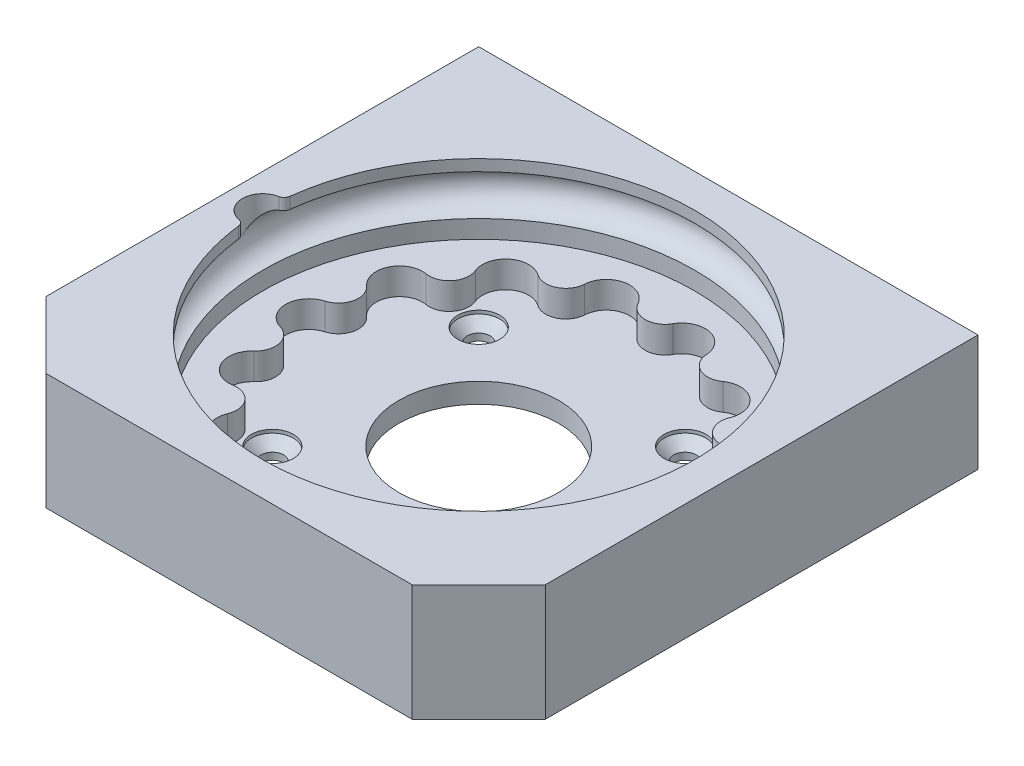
ISO-10303-21;
HEADER;
FILE_DESCRIPTION(('STEP AP214'),'2;1');
FILE_NAME('part.step','',(''),(''),'','','');
FILE_SCHEMA(('AUTOMOTIVE_DESIGN { 1 0 10303 214 1 1 1 1 }'));
ENDSEC;
DATA;
#1=APPLICATION_CONTEXT('core data for automotive mechanical design processes');
#2=APPLICATION_PROTOCOL_DEFINITION('international standard','automotive_design',2000,#1);
#3=PRODUCT_CONTEXT('',#1,'mechanical');
#4=PRODUCT('Part','Part','',(#3));
#5=PRODUCT_RELATED_PRODUCT_CATEGORY('part','',(#4));
#6=PRODUCT_DEFINITION_FORMATION('','',#4);
#7=PRODUCT_DEFINITION_CONTEXT('part definition',#1,'design');
#8=PRODUCT_DEFINITION('design','',#6,#7);
#9=PRODUCT_DEFINITION_SHAPE('','',#8);
#10=(LENGTH_UNIT() NAMED_UNIT(*) SI_UNIT(.MILLI.,.METRE.));
#11=(NAMED_UNIT(*) PLANE_ANGLE_UNIT() SI_UNIT($,.RADIAN.));
#12=(NAMED_UNIT(*) SI_UNIT($,.STERADIAN.) SOLID_ANGLE_UNIT());
#13=UNCERTAINTY_MEASURE_WITH_UNIT(LENGTH_MEASURE(1.E-05),#10,'distance_accuracy_value','');
#14=(GEOMETRIC_REPRESENTATION_CONTEXT(3) GLOBAL_UNCERTAINTY_ASSIGNED_CONTEXT((#13)) GLOBAL_UNIT_ASSIGNED_CONTEXT((#10,
#11,#12)) REPRESENTATION_CONTEXT('',''));
#15=CARTESIAN_POINT('',(0.,0.,0.));
#16=DIRECTION('',(0.,0.,1.));
#17=DIRECTION('',(1.,0.,0.));
#18=AXIS2_PLACEMENT_3D('',#15,#16,#17);
#19=CARTESIAN_POINT('',(0.,3.,0.));
#20=DIRECTION('',(0.,-1.,0.));
#21=DIRECTION('',(0.,0.,-1.));
#22=AXIS2_PLACEMENT_3D('',#19,#20,#21);
#23=PLANE('',#22);
#24=CARTESIAN_POINT('',(-15.5,3.,-15.5));
#25=DIRECTION('',(0.,1.,0.));
#26=DIRECTION('',(0.,0.,1.));
#27=AXIS2_PLACEMENT_3D('',#24,#25,#26);
#28=CIRCLE('',#27,3.15);
#29=CARTESIAN_POINT('',(-15.5,3.,-12.35));
#30=VERTEX_POINT('',#29);
#31=EDGE_CURVE('E722',#30,#30,#28,.T.);
#32=ORIENTED_EDGE('',*,*,#31,.F.);
#33=EDGE_LOOP('',(#32));
#34=FACE_BOUND('',#33,.T.);
#35=CARTESIAN_POINT('',(15.5,3.,-15.5));
#36=DIRECTION('',(0.,1.,0.));
#37=DIRECTION('',(0.,0.,1.));
#38=AXIS2_PLACEMENT_3D('',#35,#36,#37);
#39=CIRCLE('',#38,3.15);
#40=CARTESIAN_POINT('',(15.5,3.,-12.35));
#41=VERTEX_POINT('',#40);
#42=EDGE_CURVE('E712',#41,#41,#39,.T.);
#43=ORIENTED_EDGE('',*,*,#42,.F.);
#44=EDGE_LOOP('',(#43));
#45=FACE_BOUND('',#44,.T.);
#46=CARTESIAN_POINT('',(15.5,3.,15.5));
#47=DIRECTION('',(0.,1.,0.));
#48=DIRECTION('',(0.,0.,1.));
#49=AXIS2_PLACEMENT_3D('',#46,#47,#48);
#50=CIRCLE('',#49,3.15);
#51=CARTESIAN_POINT('',(15.5,3.,18.65));
#52=VERTEX_POINT('',#51);
#53=EDGE_CURVE('E702',#52,#52,#50,.T.);
#54=ORIENTED_EDGE('',*,*,#53,.F.);
#55=EDGE_LOOP('',(#54));
#56=FACE_BOUND('',#55,.T.);
#57=CARTESIAN_POINT('',(0.,3.,0.));
#58=DIRECTION('',(0.,-1.,0.));
#59=DIRECTION('',(0.,0.,-1.));
#60=AXIS2_PLACEMENT_3D('',#57,#58,#59);
#61=CIRCLE('',#60,12.);
#62=CARTESIAN_POINT('',(0.,3.,-12.));
#63=VERTEX_POINT('',#62);
#64=EDGE_CURVE('E607',#63,#63,#61,.T.);
#65=ORIENTED_EDGE('',*,*,#64,.T.);
#66=EDGE_LOOP('',(#65));
#67=FACE_BOUND('',#66,.T.);
#68=CARTESIAN_POINT('',(-27.2979815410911,3.,6.23058615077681));
#69=DIRECTION('',(0.,1.,0.));
#70=DIRECTION('',(0.,0.,1.));
#71=AXIS2_PLACEMENT_3D('',#68,#69,#70);
#72=CIRCLE('',#71,2.99999999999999);
#73=CARTESIAN_POINT('',(-25.2979540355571,3.,8.46662952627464));
#74=VERTEX_POINT('',#73);
#75=CARTESIAN_POINT('',(-26.4662018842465,3.,3.3482012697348));
#76=VERTEX_POINT('',#75);
#77=EDGE_CURVE('E313',#74,#76,#72,.T.);
#78=ORIENTED_EDGE('',*,*,#77,.F.);
#79=CARTESIAN_POINT('',(-22.9747061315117,3.,11.0640353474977));
#80=DIRECTION('',(0.,1.,0.));
#81=DIRECTION('',(0.,0.,1.));
#82=AXIS2_PLACEMENT_3D('',#79,#80,#81);
#83=CIRCLE('',#82,3.48482393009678);
#84=CARTESIAN_POINT('',(-22.3924938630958,3.,14.4998797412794));
#85=VERTEX_POINT('',#84);
#86=EDGE_CURVE('E311',#74,#85,#83,.T.);
#87=ORIENTED_EDGE('',*,*,#86,.T.);
#88=CARTESIAN_POINT('',(-21.8912815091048,3.,17.4577144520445));
#89=DIRECTION('',(0.,1.,0.));
#90=DIRECTION('',(0.,0.,1.));
#91=AXIS2_PLACEMENT_3D('',#88,#89,#90);
#92=CIRCLE('',#91,3.);
#93=CARTESIAN_POINT('',(-19.1191361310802,3.,18.6045405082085));
#94=VERTEX_POINT('',#93);
#95=EDGE_CURVE('E321',#94,#85,#92,.T.);
#96=ORIENTED_EDGE('',*,*,#95,.F.);
#97=CARTESIAN_POINT('',(-15.8989899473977,3.,19.9367028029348));
#98=DIRECTION('',(0.,1.,0.));
#99=DIRECTION('',(0.,0.,1.));
#100=AXIS2_PLACEMENT_3D('',#97,#98,#99);
#101=CIRCLE('',#100,3.48482393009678);
#102=CARTESIAN_POINT('',(-13.883677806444,3.,22.7796792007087));
#103=VERTEX_POINT('',#102);
#104=EDGE_CURVE('E451',#94,#103,#101,.T.);
#105=ORIENTED_EDGE('',*,*,#104,.T.);
#106=CARTESIAN_POINT('',(-12.1487446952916,3.,25.2271283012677));
#107=DIRECTION('',(0.,1.,0.));
#108=DIRECTION('',(0.,0.,1.));
#109=AXIS2_PLACEMENT_3D('',#106,#107,#108);
#110=CIRCLE('',#109,2.99999999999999);
#111=CARTESIAN_POINT('',(-9.15353883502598,3.,25.057594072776));
#112=VERTEX_POINT('',#111);
#113=EDGE_CURVE('E448',#112,#103,#110,.T.);
#114=ORIENTED_EDGE('',*,*,#113,.F.);
#115=CARTESIAN_POINT('',(-5.67428381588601,3.,24.8606617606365));
#116=DIRECTION('',(0.,1.,0.));
#117=DIRECTION('',(0.,0.,1.));
#118=AXIS2_PLACEMENT_3D('',#115,#116,#117);
#119=CIRCLE('',#118,3.48482393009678);
#120=CARTESIAN_POINT('',(-2.62502908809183,3.,26.5476838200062));
#121=VERTEX_POINT('',#120);
#122=EDGE_CURVE('E446',#112,#121,#119,.T.);
#123=ORIENTED_EDGE('',*,*,#122,.T.);
#124=CARTESIAN_POINT('',(0.,3.,28.));
#125=DIRECTION('',(0.,1.,0.));
#126=DIRECTION('',(0.,0.,1.));
#127=AXIS2_PLACEMENT_3D('',#124,#125,#126);
#128=CIRCLE('',#127,3.);
#129=CARTESIAN_POINT('',(2.62502908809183,3.,26.5476838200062));
#130=VERTEX_POINT('',#129);
#131=EDGE_CURVE('E443',#130,#121,#128,.T.);
#132=ORIENTED_EDGE('',*,*,#131,.F.);
#133=CARTESIAN_POINT('',(5.67428381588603,3.,24.8606617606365));
#134=DIRECTION('',(0.,1.,0.));
#135=DIRECTION('',(0.,0.,1.));
#136=AXIS2_PLACEMENT_3D('',#133,#134,#135);
#137=CIRCLE('',#136,3.48482393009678);
#138=CARTESIAN_POINT('',(9.15353883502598,3.,25.057594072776));
#139=VERTEX_POINT('',#138);
#140=EDGE_CURVE('E441',#130,#139,#137,.T.);
#141=ORIENTED_EDGE('',*,*,#140,.T.);
#142=CARTESIAN_POINT('',(12.1487446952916,3.,25.2271283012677));
#143=DIRECTION('',(0.,1.,0.));
#144=DIRECTION('',(0.,0.,1.));
#145=AXIS2_PLACEMENT_3D('',#142,#143,#144);
#146=CIRCLE('',#145,2.99999999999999);
#147=CARTESIAN_POINT('',(13.883677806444,3.,22.7796792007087));
#148=VERTEX_POINT('',#147);
#149=EDGE_CURVE('E438',#148,#139,#146,.T.);
#150=ORIENTED_EDGE('',*,*,#149,.F.);
#151=CARTESIAN_POINT('',(15.8989899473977,3.,19.9367028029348));
#152=DIRECTION('',(0.,1.,0.));
#153=DIRECTION('',(0.,0.,1.));
#154=AXIS2_PLACEMENT_3D('',#151,#152,#153);
#155=CIRCLE('',#154,3.48482393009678);
#156=CARTESIAN_POINT('',(19.1191361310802,3.,18.6045405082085));
#157=VERTEX_POINT('',#156);
#158=EDGE_CURVE('E436',#148,#157,#155,.T.);
#159=ORIENTED_EDGE('',*,*,#158,.T.);
#160=CARTESIAN_POINT('',(21.8912815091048,3.,17.4577144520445));
#161=DIRECTION('',(0.,1.,0.));
#162=DIRECTION('',(0.,0.,1.));
#163=AXIS2_PLACEMENT_3D('',#160,#161,#162);
#164=CIRCLE('',#163,3.);
#165=CARTESIAN_POINT('',(22.3924938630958,3.,14.4998797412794));
#166=VERTEX_POINT('',#165);
#167=EDGE_CURVE('E433',#166,#157,#164,.T.);
#168=ORIENTED_EDGE('',*,*,#167,.F.);
#169=CARTESIAN_POINT('',(22.9747061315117,3.,11.0640353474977));
#170=DIRECTION('',(0.,1.,0.));
#171=DIRECTION('',(0.,0.,1.));
#172=AXIS2_PLACEMENT_3D('',#169,#170,#171);
#173=CIRCLE('',#172,3.48482393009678);
#174=CARTESIAN_POINT('',(25.2979540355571,3.,8.46662952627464));
#175=VERTEX_POINT('',#174);
#176=EDGE_CURVE('E431',#166,#175,#173,.T.);
#177=ORIENTED_EDGE('',*,*,#176,.T.);
#178=CARTESIAN_POINT('',(27.2979815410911,3.,6.2305861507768));
#179=DIRECTION('',(0.,1.,0.));
#180=DIRECTION('',(0.,0.,1.));
#181=AXIS2_PLACEMENT_3D('',#178,#179,#180);
#182=CIRCLE('',#181,3.);
#183=CARTESIAN_POINT('',(26.4662018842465,3.,3.34820126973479));
#184=VERTEX_POINT('',#183);
#185=EDGE_CURVE('E428',#184,#175,#182,.T.);
#186=ORIENTED_EDGE('',*,*,#185,.F.);
#187=CARTESIAN_POINT('',(25.5,3.,0.));
#188=DIRECTION('',(0.,1.,0.));
#189=DIRECTION('',(0.,0.,1.));
#190=AXIS2_PLACEMENT_3D('',#187,#188,#189);
#191=CIRCLE('',#190,3.48482393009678);
#192=CARTESIAN_POINT('',(26.4662018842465,3.,-3.34820126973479));
#193=VERTEX_POINT('',#192);
#194=EDGE_CURVE('E426',#184,#193,#191,.T.);
#195=ORIENTED_EDGE('',*,*,#194,.T.);
#196=CARTESIAN_POINT('',(27.2979815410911,3.,-6.2305861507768));
#197=DIRECTION('',(0.,1.,0.));
#198=DIRECTION('',(0.,0.,1.));
#199=AXIS2_PLACEMENT_3D('',#196,#197,#198);
#200=CIRCLE('',#199,2.99999999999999);
#201=CARTESIAN_POINT('',(25.2979540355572,3.,-8.46662952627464));
#202=VERTEX_POINT('',#201);
#203=EDGE_CURVE('E423',#202,#193,#200,.T.);
#204=ORIENTED_EDGE('',*,*,#203,.F.);
#205=CARTESIAN_POINT('',(22.9747061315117,3.,-11.0640353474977));
#206=DIRECTION('',(0.,1.,0.));
#207=DIRECTION('',(0.,0.,1.));
#208=AXIS2_PLACEMENT_3D('',#205,#206,#207);
#209=CIRCLE('',#208,3.48482393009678);
#210=CARTESIAN_POINT('',(22.3924938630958,3.,-14.4998797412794));
#211=VERTEX_POINT('',#210);
#212=EDGE_CURVE('E421',#202,#211,#209,.T.);
#213=ORIENTED_EDGE('',*,*,#212,.T.);
#214=CARTESIAN_POINT('',(21.8912815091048,3.,-17.4577144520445));
#215=DIRECTION('',(0.,1.,0.));
#216=DIRECTION('',(0.,0.,1.));
#217=AXIS2_PLACEMENT_3D('',#214,#215,#216);
#218=CIRCLE('',#217,2.99999999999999);
#219=CARTESIAN_POINT('',(19.1191361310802,3.,-18.6045405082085));
#220=VERTEX_POINT('',#219);
#221=EDGE_CURVE('E418',#220,#211,#218,.T.);
#222=ORIENTED_EDGE('',*,*,#221,.F.);
#223=CARTESIAN_POINT('',(15.8989899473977,3.,-19.9367028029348));
#224=DIRECTION('',(0.,1.,0.));
#225=DIRECTION('',(0.,0.,1.));
#226=AXIS2_PLACEMENT_3D('',#223,#224,#225);
#227=CIRCLE('',#226,3.48482393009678);
#228=CARTESIAN_POINT('',(13.883677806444,3.,-22.7796792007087));
#229=VERTEX_POINT('',#228);
#230=EDGE_CURVE('E416',#220,#229,#227,.T.);
#231=ORIENTED_EDGE('',*,*,#230,.T.);
#232=CARTESIAN_POINT('',(12.1487446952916,3.,-25.2271283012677));
#233=DIRECTION('',(0.,1.,0.));
#234=DIRECTION('',(0.,0.,1.));
#235=AXIS2_PLACEMENT_3D('',#232,#233,#234);
#236=CIRCLE('',#235,3.);
#237=CARTESIAN_POINT('',(9.15353883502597,3.,-25.057594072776));
#238=VERTEX_POINT('',#237);
#239=EDGE_CURVE('E413',#238,#229,#236,.T.);
#240=ORIENTED_EDGE('',*,*,#239,.F.);
#241=CARTESIAN_POINT('',(5.67428381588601,3.,-24.8606617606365));
#242=DIRECTION('',(0.,1.,0.));
#243=DIRECTION('',(0.,0.,1.));
#244=AXIS2_PLACEMENT_3D('',#241,#242,#243);
#245=CIRCLE('',#244,3.48482393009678);
#246=CARTESIAN_POINT('',(2.62502908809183,3.,-26.5476838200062));
#247=VERTEX_POINT('',#246);
#248=EDGE_CURVE('E411',#238,#247,#245,.T.);
#249=ORIENTED_EDGE('',*,*,#248,.T.);
#250=CARTESIAN_POINT('',(0.,3.,-28.));
#251=DIRECTION('',(0.,1.,0.));
#252=DIRECTION('',(0.,0.,1.));
#253=AXIS2_PLACEMENT_3D('',#250,#251,#252);
#254=CIRCLE('',#253,3.);
#255=CARTESIAN_POINT('',(-2.62502908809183,3.,-26.5476838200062));
#256=VERTEX_POINT('',#255);
#257=EDGE_CURVE('E408',#256,#247,#254,.T.);
#258=ORIENTED_EDGE('',*,*,#257,.F.);
#259=CARTESIAN_POINT('',(-5.67428381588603,3.,-24.8606617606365));
#260=DIRECTION('',(0.,1.,0.));
#261=DIRECTION('',(0.,0.,1.));
#262=AXIS2_PLACEMENT_3D('',#259,#260,#261);
#263=CIRCLE('',#262,3.48482393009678);
#264=CARTESIAN_POINT('',(-9.15353883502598,3.,-25.057594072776));
#265=VERTEX_POINT('',#264);
#266=EDGE_CURVE('E406',#256,#265,#263,.T.);
#267=ORIENTED_EDGE('',*,*,#266,.T.);
#268=CARTESIAN_POINT('',(-12.1487446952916,3.,-25.2271283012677));
#269=DIRECTION('',(0.,1.,0.));
#270=DIRECTION('',(0.,0.,1.));
#271=AXIS2_PLACEMENT_3D('',#268,#269,#270);
#272=CIRCLE('',#271,3.);
#273=CARTESIAN_POINT('',(-13.883677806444,3.,-22.7796792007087));
#274=VERTEX_POINT('',#273);
#275=EDGE_CURVE('E403',#274,#265,#272,.T.);
#276=ORIENTED_EDGE('',*,*,#275,.F.);
#277=CARTESIAN_POINT('',(-15.8989899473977,3.,-19.9367028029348));
#278=DIRECTION('',(0.,1.,0.));
#279=DIRECTION('',(0.,0.,1.));
#280=AXIS2_PLACEMENT_3D('',#277,#278,#279);
#281=CIRCLE('',#280,3.48482393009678);
#282=CARTESIAN_POINT('',(-19.1191361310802,3.,-18.6045405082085));
#283=VERTEX_POINT('',#282);
#284=EDGE_CURVE('E401',#274,#283,#281,.T.);
#285=ORIENTED_EDGE('',*,*,#284,.T.);
#286=CARTESIAN_POINT('',(-21.8912815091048,3.,-17.4577144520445));
#287=DIRECTION('',(0.,1.,0.));
#288=DIRECTION('',(0.,0.,1.));
#289=AXIS2_PLACEMENT_3D('',#286,#287,#288);
#290=CIRCLE('',#289,3.);
#291=CARTESIAN_POINT('',(-22.3924938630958,3.,-14.4998797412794));
#292=VERTEX_POINT('',#291);
#293=EDGE_CURVE('E398',#292,#283,#290,.T.);
#294=ORIENTED_EDGE('',*,*,#293,.F.);
#295=CARTESIAN_POINT('',(-22.9747061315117,3.,-11.0640353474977));
#296=DIRECTION('',(0.,1.,0.));
#297=DIRECTION('',(0.,0.,1.));
#298=AXIS2_PLACEMENT_3D('',#295,#296,#297);
#299=CIRCLE('',#298,3.48482393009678);
#300=CARTESIAN_POINT('',(-25.2979540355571,3.,-8.46662952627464));
#301=VERTEX_POINT('',#300);
#302=EDGE_CURVE('E396',#292,#301,#299,.T.);
#303=ORIENTED_EDGE('',*,*,#302,.T.);
#304=CARTESIAN_POINT('',(-27.2979815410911,3.,-6.2305861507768));
#305=DIRECTION('',(0.,1.,0.));
#306=DIRECTION('',(0.,0.,1.));
#307=AXIS2_PLACEMENT_3D('',#304,#305,#306);
#308=CIRCLE('',#307,3.);
#309=CARTESIAN_POINT('',(-26.4662018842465,3.,-3.34820126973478));
#310=VERTEX_POINT('',#309);
#311=EDGE_CURVE('E393',#310,#301,#308,.T.);
#312=ORIENTED_EDGE('',*,*,#311,.F.);
#313=CARTESIAN_POINT('',(-25.5,3.,0.));
#314=DIRECTION('',(0.,1.,0.));
#315=DIRECTION('',(0.,0.,1.));
#316=AXIS2_PLACEMENT_3D('',#313,#314,#315);
#317=CIRCLE('',#316,3.48482393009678);
#318=EDGE_CURVE('E391',#310,#76,#317,.T.);
#319=ORIENTED_EDGE('',*,*,#318,.T.);
#320=EDGE_LOOP('',(#78,#87,#96,#105,#114,#123,#132,#141,#150,#159,#168,#177,#186,#195,#204,#213,
#222,#231,#240,#249,#258,#267,#276,#285,#294,#303,#312,#319));
#321=FACE_BOUND('',#320,.T.);
#322=CARTESIAN_POINT('',(-15.5,3.,15.5));
#323=DIRECTION('',(0.,1.,0.));
#324=DIRECTION('',(0.,0.,1.));
#325=AXIS2_PLACEMENT_3D('',#322,#323,#324);
#326=CIRCLE('',#325,3.15);
#327=CARTESIAN_POINT('',(-15.5,3.,18.65));
#328=VERTEX_POINT('',#327);
#329=EDGE_CURVE('E692',#328,#328,#326,.T.);
#330=ORIENTED_EDGE('',*,*,#329,.F.);
#331=EDGE_LOOP('',(#330));
#332=FACE_BOUND('',#331,.T.);
#333=ADVANCED_FACE('F36',(#34,#45,#56,#67,#321,#332),#23,.F.);
#334=CARTESIAN_POINT('',(0.,17.5,0.));
#335=DIRECTION('',(0.,-1.,0.));
#336=DIRECTION('',(0.,0.,-1.));
#337=AXIS2_PLACEMENT_3D('',#334,#335,#336);
#338=CYLINDRICAL_SURFACE('',#337,32.45);
#339=CARTESIAN_POINT('',(0.,7.,0.));
#340=DIRECTION('',(0.,1.,0.));
#341=DIRECTION('',(0.,0.,1.));
#342=AXIS2_PLACEMENT_3D('',#339,#340,#341);
#343=CIRCLE('',#342,32.45);
#344=CARTESIAN_POINT('',(0.,7.,-32.45));
#345=VERTEX_POINT('',#344);
#346=EDGE_CURVE('E306',#345,#345,#343,.F.);
#347=CARTESIAN_POINT('',(0.,9.7,0.));
#348=DIRECTION('',(0.,1.,0.));
#349=DIRECTION('',(0.,0.,1.));
#350=AXIS2_PLACEMENT_3D('',#347,#348,#349);
#351=CIRCLE('',#350,32.45);
#352=CARTESIAN_POINT('',(0.,9.7,-32.45));
#353=VERTEX_POINT('',#352);
#354=EDGE_CURVE('E569',#353,#353,#351,.T.);
#355=CARTESIAN_POINT('',(0.,7.,-32.45));
#356=CARTESIAN_POINT('',(0.,7.028125,-32.45));
#357=CARTESIAN_POINT('',(0.,7.05625,-32.45));
#358=CARTESIAN_POINT('',(0.,7.1125,-32.45));
#359=CARTESIAN_POINT('',(0.,7.140625,-32.45));
#360=CARTESIAN_POINT('',(0.,7.196875,-32.45));
#361=CARTESIAN_POINT('',(0.,7.225,-32.45));
#362=CARTESIAN_POINT('',(0.,7.28125,-32.45));
#363=CARTESIAN_POINT('',(0.,7.309375,-32.45));
#364=CARTESIAN_POINT('',(0.,7.365625,-32.45));
#365=CARTESIAN_POINT('',(0.,7.39375,-32.45));
#366=CARTESIAN_POINT('',(0.,7.45,-32.45));
#367=CARTESIAN_POINT('',(0.,7.478125,-32.45));
#368=CARTESIAN_POINT('',(0.,7.534375,-32.45));
#369=CARTESIAN_POINT('',(0.,7.5625,-32.45));
#370=CARTESIAN_POINT('',(0.,7.61875,-32.45));
#371=CARTESIAN_POINT('',(0.,7.646875,-32.45));
#372=CARTESIAN_POINT('',(0.,7.703125,-32.45));
#373=CARTESIAN_POINT('',(0.,7.73125,-32.45));
#374=CARTESIAN_POINT('',(0.,7.7875,-32.45));
#375=CARTESIAN_POINT('',(0.,7.815625,-32.45));
#376=CARTESIAN_POINT('',(0.,7.871875,-32.45));
#377=CARTESIAN_POINT('',(0.,7.9,-32.45));
#378=CARTESIAN_POINT('',(0.,7.95625,-32.45));
#379=CARTESIAN_POINT('',(0.,7.984375,-32.45));
#380=CARTESIAN_POINT('',(0.,8.040625,-32.45));
#381=CARTESIAN_POINT('',(0.,8.06875,-32.45));
#382=CARTESIAN_POINT('',(0.,8.125,-32.45));
#383=CARTESIAN_POINT('',(0.,8.153125,-32.45));
#384=CARTESIAN_POINT('',(0.,8.209375,-32.45));
#385=CARTESIAN_POINT('',(0.,8.2375,-32.45));
#386=CARTESIAN_POINT('',(0.,8.29375,-32.45));
#387=CARTESIAN_POINT('',(0.,8.321875,-32.45));
#388=CARTESIAN_POINT('',(0.,8.378125,-32.45));
#389=CARTESIAN_POINT('',(0.,8.40625,-32.45));
#390=CARTESIAN_POINT('',(0.,8.4625,-32.45));
#391=CARTESIAN_POINT('',(0.,8.490625,-32.45));
#392=CARTESIAN_POINT('',(0.,8.546875,-32.45));
#393=CARTESIAN_POINT('',(0.,8.575,-32.45));
#394=CARTESIAN_POINT('',(0.,8.63125,-32.45));
#395=CARTESIAN_POINT('',(0.,8.659375,-32.45));
#396=CARTESIAN_POINT('',(0.,8.715625,-32.45));
#397=CARTESIAN_POINT('',(0.,8.74375,-32.45));
#398=CARTESIAN_POINT('',(0.,8.8,-32.45));
#399=CARTESIAN_POINT('',(0.,8.828125,-32.45));
#400=CARTESIAN_POINT('',(0.,8.884375,-32.45));
#401=CARTESIAN_POINT('',(0.,8.9125,-32.45));
#402=CARTESIAN_POINT('',(0.,8.96875,-32.45));
#403=CARTESIAN_POINT('',(0.,8.996875,-32.45));
#404=CARTESIAN_POINT('',(0.,9.053125,-32.45));
#405=CARTESIAN_POINT('',(0.,9.08125,-32.45));
#406=CARTESIAN_POINT('',(0.,9.1375,-32.45));
#407=CARTESIAN_POINT('',(0.,9.165625,-32.45));
#408=CARTESIAN_POINT('',(0.,9.221875,-32.45));
#409=CARTESIAN_POINT('',(0.,9.25,-32.45));
#410=CARTESIAN_POINT('',(0.,9.30625,-32.45));
#411=CARTESIAN_POINT('',(0.,9.334375,-32.45));
#412=CARTESIAN_POINT('',(0.,9.390625,-32.45));
#413=CARTESIAN_POINT('',(0.,9.41875,-32.45));
#414=CARTESIAN_POINT('',(0.,9.475,-32.45));
#415=CARTESIAN_POINT('',(0.,9.503125,-32.45));
#416=CARTESIAN_POINT('',(0.,9.559375,-32.45));
#417=CARTESIAN_POINT('',(0.,9.5875,-32.45));
#418=CARTESIAN_POINT('',(0.,9.64375,-32.45));
#419=CARTESIAN_POINT('',(0.,9.671875,-32.45));
#420=CARTESIAN_POINT('',(0.,9.7,-32.45));
#421=B_SPLINE_CURVE_WITH_KNOTS('',3,(#355,#356,#357,#358,#359,#360,#361,#362,#363,#364,#365,
#366,#367,#368,#369,#370,#371,#372,#373,#374,#375,#376,#377,#378,#379,#380,#381,#382,#383,#384,
#385,#386,#387,#388,#389,#390,#391,#392,#393,#394,#395,#396,#397,#398,#399,#400,#401,#402,#403,
#404,#405,#406,#407,#408,#409,#410,#411,#412,#413,#414,#415,#416,#417,#418,#419,#420),
.UNSPECIFIED.,.F.,.F.,(4,2,2,2,2,2,2,2,2,2,2,2,2,2,2,2,2,2,2,2,2,2,2,2,2,2,2,2,2,2,2,2,4),(0.,
0.0843749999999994,0.168750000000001,0.253125,0.337500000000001,0.421875,0.50625,
0.590625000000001,0.675,0.759375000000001,0.843750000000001,0.928125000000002,1.0125,1.096875,
1.18125,1.265625,1.35,1.434375,1.51875,1.603125,1.6875,1.771875,1.85625,1.940625,2.025,2.109375,
2.19375,2.278125,2.3625,2.446875,2.53125,2.615625,2.7),.UNSPECIFIED.);
#422=EDGE_CURVE('BSEAM641',#345,#353,#421,.T.);
#423=ORIENTED_EDGE('',*,*,#346,.T.);
#424=ORIENTED_EDGE('',*,*,#354,.T.);
#425=ORIENTED_EDGE('',*,*,#422,.T.);
#426=ORIENTED_EDGE('',*,*,#422,.F.);
#427=EDGE_LOOP('',(#423,#425,#424,#426));
#428=FACE_BOUND('',#427,.T.);
#429=ADVANCED_FACE('F641',(#428),#338,.F.);
#430=CARTESIAN_POINT('',(0.,15.8,0.));
#431=DIRECTION('',(0.,-1.,0.));
#432=DIRECTION('',(0.,0.,-1.));
#433=AXIS2_PLACEMENT_3D('',#430,#431,#432);
#434=CIRCLE('',#433,32.45);
#435=CARTESIAN_POINT('',(-32.2197683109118,15.8,-3.8586305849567));
#436=VERTEX_POINT('',#435);
#437=CARTESIAN_POINT('',(-32.2197683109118,15.8,3.8586305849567));
#438=VERTEX_POINT('',#437);
#439=EDGE_CURVE('E567',#436,#438,#434,.T.);
#440=ORIENTED_EDGE('',*,*,#439,.T.);
#441=DIRECTION('',(0.,-1.,0.));
#442=VECTOR('',#441,1.);
#443=CARTESIAN_POINT('',(-32.2197683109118,17.5,3.8586305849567));
#444=LINE('',#443,#442);
#445=CARTESIAN_POINT('',(-32.2197683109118,17.5,3.8586305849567));
#446=VERTEX_POINT('',#445);
#447=EDGE_CURVE('E58',#438,#446,#444,.F.);
#448=ORIENTED_EDGE('',*,*,#447,.T.);
#449=CARTESIAN_POINT('',(0.,17.5,0.));
#450=DIRECTION('',(0.,1.,0.));
#451=DIRECTION('',(0.,0.,1.));
#452=AXIS2_PLACEMENT_3D('',#449,#450,#451);
#453=CIRCLE('',#452,32.45);
#454=CARTESIAN_POINT('',(-32.2197683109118,17.5,-3.8586305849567));
#455=VERTEX_POINT('',#454);
#456=EDGE_CURVE('E573',#446,#455,#453,.T.);
#457=ORIENTED_EDGE('',*,*,#456,.T.);
#458=DIRECTION('',(0.,-1.,0.));
#459=VECTOR('',#458,1.);
#460=CARTESIAN_POINT('',(-32.2197683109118,17.5,-3.8586305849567));
#461=LINE('',#460,#459);
#462=EDGE_CURVE('E936',#455,#436,#461,.T.);
#463=ORIENTED_EDGE('',*,*,#462,.T.);
#464=EDGE_LOOP('',(#440,#448,#457,#463));
#465=FACE_BOUND('',#464,.T.);
#466=ADVANCED_FACE('F647',(#465),#338,.F.);
#467=CARTESIAN_POINT('',(0.,7.,0.));
#468=DIRECTION('',(0.,1.,0.));
#469=DIRECTION('',(0.,0.,1.));
#470=AXIS2_PLACEMENT_3D('',#467,#468,#469);
#471=PLANE('',#470);
#472=CARTESIAN_POINT('',(-22.9747061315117,7.,11.0640353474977));
#473=DIRECTION('',(0.,1.,0.));
#474=DIRECTION('',(0.,0.,1.));
#475=AXIS2_PLACEMENT_3D('',#472,#473,#474);
#476=CIRCLE('',#475,3.48482393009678);
#477=CARTESIAN_POINT('',(-25.2979540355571,7.,8.46662952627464));
#478=VERTEX_POINT('',#477);
#479=CARTESIAN_POINT('',(-22.3924938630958,7.,14.4998797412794));
#480=VERTEX_POINT('',#479);
#481=EDGE_CURVE('E317',#478,#480,#476,.T.);
#482=ORIENTED_EDGE('',*,*,#481,.F.);
#483=CARTESIAN_POINT('',(-27.2979815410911,7.,6.23058615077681));
#484=DIRECTION('',(0.,1.,0.));
#485=DIRECTION('',(0.,0.,1.));
#486=AXIS2_PLACEMENT_3D('',#483,#484,#485);
#487=CIRCLE('',#486,2.99999999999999);
#488=CARTESIAN_POINT('',(-26.4662018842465,7.,3.3482012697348));
#489=VERTEX_POINT('',#488);
#490=EDGE_CURVE('E320',#478,#489,#487,.T.);
#491=ORIENTED_EDGE('',*,*,#490,.T.);
#492=CARTESIAN_POINT('',(-25.5,7.,0.));
#493=DIRECTION('',(0.,1.,0.));
#494=DIRECTION('',(0.,0.,1.));
#495=AXIS2_PLACEMENT_3D('',#492,#493,#494);
#496=CIRCLE('',#495,3.48482393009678);
#497=CARTESIAN_POINT('',(-26.4662018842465,7.,-3.34820126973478));
#498=VERTEX_POINT('',#497);
#499=EDGE_CURVE('E323',#498,#489,#496,.T.);
#500=ORIENTED_EDGE('',*,*,#499,.F.);
#501=CARTESIAN_POINT('',(-27.2979815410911,7.,-6.2305861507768));
#502=DIRECTION('',(0.,1.,0.));
#503=DIRECTION('',(0.,0.,1.));
#504=AXIS2_PLACEMENT_3D('',#501,#502,#503);
#505=CIRCLE('',#504,3.);
#506=CARTESIAN_POINT('',(-25.2979540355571,7.,-8.46662952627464));
#507=VERTEX_POINT('',#506);
#508=EDGE_CURVE('E326',#498,#507,#505,.T.);
#509=ORIENTED_EDGE('',*,*,#508,.T.);
#510=CARTESIAN_POINT('',(-22.9747061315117,7.,-11.0640353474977));
#511=DIRECTION('',(0.,1.,0.));
#512=DIRECTION('',(0.,0.,1.));
#513=AXIS2_PLACEMENT_3D('',#510,#511,#512);
#514=CIRCLE('',#513,3.48482393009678);
#515=CARTESIAN_POINT('',(-22.3924938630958,7.,-14.4998797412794));
#516=VERTEX_POINT('',#515);
#517=EDGE_CURVE('E328',#516,#507,#514,.T.);
#518=ORIENTED_EDGE('',*,*,#517,.F.);
#519=CARTESIAN_POINT('',(-21.8912815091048,7.,-17.4577144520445));
#520=DIRECTION('',(0.,1.,0.));
#521=DIRECTION('',(0.,0.,1.));
#522=AXIS2_PLACEMENT_3D('',#519,#520,#521);
#523=CIRCLE('',#522,3.);
#524=CARTESIAN_POINT('',(-19.1191361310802,7.,-18.6045405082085));
#525=VERTEX_POINT('',#524);
#526=EDGE_CURVE('E331',#516,#525,#523,.T.);
#527=ORIENTED_EDGE('',*,*,#526,.T.);
#528=CARTESIAN_POINT('',(-15.8989899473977,7.,-19.9367028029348));
#529=DIRECTION('',(0.,1.,0.));
#530=DIRECTION('',(0.,0.,1.));
#531=AXIS2_PLACEMENT_3D('',#528,#529,#530);
#532=CIRCLE('',#531,3.48482393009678);
#533=CARTESIAN_POINT('',(-13.883677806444,7.,-22.7796792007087));
#534=VERTEX_POINT('',#533);
#535=EDGE_CURVE('E333',#534,#525,#532,.T.);
#536=ORIENTED_EDGE('',*,*,#535,.F.);
#537=CARTESIAN_POINT('',(-12.1487446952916,7.,-25.2271283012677));
#538=DIRECTION('',(0.,1.,0.));
#539=DIRECTION('',(0.,0.,1.));
#540=AXIS2_PLACEMENT_3D('',#537,#538,#539);
#541=CIRCLE('',#540,3.);
#542=CARTESIAN_POINT('',(-9.15353883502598,7.,-25.057594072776));
#543=VERTEX_POINT('',#542);
#544=EDGE_CURVE('E336',#534,#543,#541,.T.);
#545=ORIENTED_EDGE('',*,*,#544,.T.);
#546=CARTESIAN_POINT('',(-5.67428381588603,7.,-24.8606617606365));
#547=DIRECTION('',(0.,1.,0.));
#548=DIRECTION('',(0.,0.,1.));
#549=AXIS2_PLACEMENT_3D('',#546,#547,#548);
#550=CIRCLE('',#549,3.48482393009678);
#551=CARTESIAN_POINT('',(-2.62502908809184,7.,-26.5476838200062));
#552=VERTEX_POINT('',#551);
#553=EDGE_CURVE('E338',#552,#543,#550,.T.);
#554=ORIENTED_EDGE('',*,*,#553,.F.);
#555=CARTESIAN_POINT('',(0.,7.,-28.));
#556=DIRECTION('',(0.,1.,0.));
#557=DIRECTION('',(0.,0.,1.));
#558=AXIS2_PLACEMENT_3D('',#555,#556,#557);
#559=CIRCLE('',#558,3.);
#560=CARTESIAN_POINT('',(2.62502908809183,7.,-26.5476838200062));
#561=VERTEX_POINT('',#560);
#562=EDGE_CURVE('E341',#552,#561,#559,.T.);
#563=ORIENTED_EDGE('',*,*,#562,.T.);
#564=CARTESIAN_POINT('',(5.67428381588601,7.,-24.8606617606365));
#565=DIRECTION('',(0.,1.,0.));
#566=DIRECTION('',(0.,0.,1.));
#567=AXIS2_PLACEMENT_3D('',#564,#565,#566);
#568=CIRCLE('',#567,3.48482393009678);
#569=CARTESIAN_POINT('',(9.15353883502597,7.,-25.057594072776));
#570=VERTEX_POINT('',#569);
#571=EDGE_CURVE('E343',#570,#561,#568,.T.);
#572=ORIENTED_EDGE('',*,*,#571,.F.);
#573=CARTESIAN_POINT('',(12.1487446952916,7.,-25.2271283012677));
#574=DIRECTION('',(0.,1.,0.));
#575=DIRECTION('',(0.,0.,1.));
#576=AXIS2_PLACEMENT_3D('',#573,#574,#575);
#577=CIRCLE('',#576,3.);
#578=CARTESIAN_POINT('',(13.883677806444,7.,-22.7796792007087));
#579=VERTEX_POINT('',#578);
#580=EDGE_CURVE('E346',#570,#579,#577,.T.);
#581=ORIENTED_EDGE('',*,*,#580,.T.);
#582=CARTESIAN_POINT('',(15.8989899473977,7.,-19.9367028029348));
#583=DIRECTION('',(0.,1.,0.));
#584=DIRECTION('',(0.,0.,1.));
#585=AXIS2_PLACEMENT_3D('',#582,#583,#584);
#586=CIRCLE('',#585,3.48482393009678);
#587=CARTESIAN_POINT('',(19.1191361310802,7.,-18.6045405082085));
#588=VERTEX_POINT('',#587);
#589=EDGE_CURVE('E348',#588,#579,#586,.T.);
#590=ORIENTED_EDGE('',*,*,#589,.F.);
#591=CARTESIAN_POINT('',(21.8912815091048,7.,-17.4577144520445));
#592=DIRECTION('',(0.,1.,0.));
#593=DIRECTION('',(0.,0.,1.));
#594=AXIS2_PLACEMENT_3D('',#591,#592,#593);
#595=CIRCLE('',#594,2.99999999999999);
#596=CARTESIAN_POINT('',(22.3924938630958,7.,-14.4998797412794));
#597=VERTEX_POINT('',#596);
#598=EDGE_CURVE('E351',#588,#597,#595,.T.);
#599=ORIENTED_EDGE('',*,*,#598,.T.);
#600=CARTESIAN_POINT('',(22.9747061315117,7.,-11.0640353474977));
#601=DIRECTION('',(0.,1.,0.));
#602=DIRECTION('',(0.,0.,1.));
#603=AXIS2_PLACEMENT_3D('',#600,#601,#602);
#604=CIRCLE('',#603,3.48482393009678);
#605=CARTESIAN_POINT('',(25.2979540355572,7.,-8.46662952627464));
#606=VERTEX_POINT('',#605);
#607=EDGE_CURVE('E353',#606,#597,#604,.T.);
#608=ORIENTED_EDGE('',*,*,#607,.F.);
#609=CARTESIAN_POINT('',(27.2979815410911,7.,-6.2305861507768));
#610=DIRECTION('',(0.,1.,0.));
#611=DIRECTION('',(0.,0.,1.));
#612=AXIS2_PLACEMENT_3D('',#609,#610,#611);
#613=CIRCLE('',#612,2.99999999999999);
#614=CARTESIAN_POINT('',(26.4662018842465,7.,-3.3482012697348));
#615=VERTEX_POINT('',#614);
#616=EDGE_CURVE('E356',#606,#615,#613,.T.);
#617=ORIENTED_EDGE('',*,*,#616,.T.);
#618=CARTESIAN_POINT('',(25.5,7.,0.));
#619=DIRECTION('',(0.,1.,0.));
#620=DIRECTION('',(0.,0.,1.));
#621=AXIS2_PLACEMENT_3D('',#618,#619,#620);
#622=CIRCLE('',#621,3.48482393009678);
#623=CARTESIAN_POINT('',(26.4662018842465,7.,3.34820126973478));
#624=VERTEX_POINT('',#623);
#625=EDGE_CURVE('E358',#624,#615,#622,.T.);
#626=ORIENTED_EDGE('',*,*,#625,.F.);
#627=CARTESIAN_POINT('',(27.2979815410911,7.,6.2305861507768));
#628=DIRECTION('',(0.,1.,0.));
#629=DIRECTION('',(0.,0.,1.));
#630=AXIS2_PLACEMENT_3D('',#627,#628,#629);
#631=CIRCLE('',#630,3.);
#632=CARTESIAN_POINT('',(25.2979540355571,7.,8.46662952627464));
#633=VERTEX_POINT('',#632);
#634=EDGE_CURVE('E361',#624,#633,#631,.T.);
#635=ORIENTED_EDGE('',*,*,#634,.T.);
#636=CARTESIAN_POINT('',(22.9747061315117,7.,11.0640353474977));
#637=DIRECTION('',(0.,1.,0.));
#638=DIRECTION('',(0.,0.,1.));
#639=AXIS2_PLACEMENT_3D('',#636,#637,#638);
#640=CIRCLE('',#639,3.48482393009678);
#641=CARTESIAN_POINT('',(22.3924938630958,7.,14.4998797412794));
#642=VERTEX_POINT('',#641);
#643=EDGE_CURVE('E363',#642,#633,#640,.T.);
#644=ORIENTED_EDGE('',*,*,#643,.F.);
#645=CARTESIAN_POINT('',(21.8912815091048,7.,17.4577144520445));
#646=DIRECTION('',(0.,1.,0.));
#647=DIRECTION('',(0.,0.,1.));
#648=AXIS2_PLACEMENT_3D('',#645,#646,#647);
#649=CIRCLE('',#648,3.);
#650=CARTESIAN_POINT('',(19.1191361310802,7.,18.6045405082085));
#651=VERTEX_POINT('',#650);
#652=EDGE_CURVE('E366',#642,#651,#649,.T.);
#653=ORIENTED_EDGE('',*,*,#652,.T.);
#654=CARTESIAN_POINT('',(15.8989899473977,7.,19.9367028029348));
#655=DIRECTION('',(0.,1.,0.));
#656=DIRECTION('',(0.,0.,1.));
#657=AXIS2_PLACEMENT_3D('',#654,#655,#656);
#658=CIRCLE('',#657,3.48482393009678);
#659=CARTESIAN_POINT('',(13.883677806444,7.,22.7796792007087));
#660=VERTEX_POINT('',#659);
#661=EDGE_CURVE('E368',#660,#651,#658,.T.);
#662=ORIENTED_EDGE('',*,*,#661,.F.);
#663=CARTESIAN_POINT('',(12.1487446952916,7.,25.2271283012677));
#664=DIRECTION('',(0.,1.,0.));
#665=DIRECTION('',(0.,0.,1.));
#666=AXIS2_PLACEMENT_3D('',#663,#664,#665);
#667=CIRCLE('',#666,2.99999999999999);
#668=CARTESIAN_POINT('',(9.15353883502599,7.,25.057594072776));
#669=VERTEX_POINT('',#668);
#670=EDGE_CURVE('E371',#660,#669,#667,.T.);
#671=ORIENTED_EDGE('',*,*,#670,.T.);
#672=CARTESIAN_POINT('',(5.67428381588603,7.,24.8606617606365));
#673=DIRECTION('',(0.,1.,0.));
#674=DIRECTION('',(0.,0.,1.));
#675=AXIS2_PLACEMENT_3D('',#672,#673,#674);
#676=CIRCLE('',#675,3.48482393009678);
#677=CARTESIAN_POINT('',(2.62502908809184,7.,26.5476838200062));
#678=VERTEX_POINT('',#677);
#679=EDGE_CURVE('E373',#678,#669,#676,.T.);
#680=ORIENTED_EDGE('',*,*,#679,.F.);
#681=CARTESIAN_POINT('',(0.,7.,28.));
#682=DIRECTION('',(0.,1.,0.));
#683=DIRECTION('',(0.,0.,1.));
#684=AXIS2_PLACEMENT_3D('',#681,#682,#683);
#685=CIRCLE('',#684,3.);
#686=CARTESIAN_POINT('',(-2.62502908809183,7.,26.5476838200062));
#687=VERTEX_POINT('',#686);
#688=EDGE_CURVE('E376',#678,#687,#685,.T.);
#689=ORIENTED_EDGE('',*,*,#688,.T.);
#690=CARTESIAN_POINT('',(-5.67428381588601,7.,24.8606617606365));
#691=DIRECTION('',(0.,1.,0.));
#692=DIRECTION('',(0.,0.,1.));
#693=AXIS2_PLACEMENT_3D('',#690,#691,#692);
#694=CIRCLE('',#693,3.48482393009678);
#695=CARTESIAN_POINT('',(-9.15353883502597,7.,25.057594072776));
#696=VERTEX_POINT('',#695);
#697=EDGE_CURVE('E378',#696,#687,#694,.T.);
#698=ORIENTED_EDGE('',*,*,#697,.F.);
#699=CARTESIAN_POINT('',(-12.1487446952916,7.,25.2271283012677));
#700=DIRECTION('',(0.,1.,0.));
#701=DIRECTION('',(0.,0.,1.));
#702=AXIS2_PLACEMENT_3D('',#699,#700,#701);
#703=CIRCLE('',#702,2.99999999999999);
#704=CARTESIAN_POINT('',(-13.883677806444,7.,22.7796792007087));
#705=VERTEX_POINT('',#704);
#706=EDGE_CURVE('E381',#696,#705,#703,.T.);
#707=ORIENTED_EDGE('',*,*,#706,.T.);
#708=CARTESIAN_POINT('',(-15.8989899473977,7.,19.9367028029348));
#709=DIRECTION('',(0.,1.,0.));
#710=DIRECTION('',(0.,0.,1.));
#711=AXIS2_PLACEMENT_3D('',#708,#709,#710);
#712=CIRCLE('',#711,3.48482393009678);
#713=CARTESIAN_POINT('',(-19.1191361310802,7.,18.6045405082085));
#714=VERTEX_POINT('',#713);
#715=EDGE_CURVE('E383',#714,#705,#712,.T.);
#716=ORIENTED_EDGE('',*,*,#715,.F.);
#717=CARTESIAN_POINT('',(-21.8912815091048,7.,17.4577144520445));
#718=DIRECTION('',(0.,1.,0.));
#719=DIRECTION('',(0.,0.,1.));
#720=AXIS2_PLACEMENT_3D('',#717,#718,#719);
#721=CIRCLE('',#720,3.);
#722=EDGE_CURVE('E386',#714,#480,#721,.T.);
#723=ORIENTED_EDGE('',*,*,#722,.T.);
#724=EDGE_LOOP('',(#482,#491,#500,#509,#518,#527,#536,#545,#554,#563,#572,#581,#590,#599,#608,
#617,#626,#635,#644,#653,#662,#671,#680,#689,#698,#707,#716,#723));
#725=FACE_BOUND('',#724,.T.);
#726=ORIENTED_EDGE('',*,*,#346,.F.);
#727=EDGE_LOOP('',(#726));
#728=FACE_BOUND('',#727,.T.);
#729=ADVANCED_FACE('F653',(#725,#728),#471,.T.);
#730=CARTESIAN_POINT('',(0.,0.,0.));
#731=DIRECTION('',(0.,-1.,0.));
#732=DIRECTION('',(0.,0.,-1.));
#733=AXIS2_PLACEMENT_3D('',#730,#731,#732);
#734=PLANE('',#733);
#735=CARTESIAN_POINT('',(-15.5,0.,-15.5));
#736=DIRECTION('',(0.,1.,0.));
#737=DIRECTION('',(0.,0.,1.));
#738=AXIS2_PLACEMENT_3D('',#735,#736,#737);
#739=CIRCLE('',#738,1.70000000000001);
#740=CARTESIAN_POINT('',(-15.5,0.,-13.8));
#741=VERTEX_POINT('',#740);
#742=EDGE_CURVE('E665',#741,#741,#739,.T.);
#743=ORIENTED_EDGE('',*,*,#742,.T.);
#744=EDGE_LOOP('',(#743));
#745=FACE_BOUND('',#744,.T.);
#746=CARTESIAN_POINT('',(15.5,0.,-15.5));
#747=DIRECTION('',(0.,1.,0.));
#748=DIRECTION('',(0.,0.,1.));
#749=AXIS2_PLACEMENT_3D('',#746,#747,#748);
#750=CIRCLE('',#749,1.70000000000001);
#751=CARTESIAN_POINT('',(15.5,0.,-13.8));
#752=VERTEX_POINT('',#751);
#753=EDGE_CURVE('E669',#752,#752,#750,.T.);
#754=ORIENTED_EDGE('',*,*,#753,.T.);
#755=EDGE_LOOP('',(#754));
#756=FACE_BOUND('',#755,.T.);
#757=CARTESIAN_POINT('',(15.5,0.,15.5));
#758=DIRECTION('',(0.,1.,0.));
#759=DIRECTION('',(0.,0.,1.));
#760=AXIS2_PLACEMENT_3D('',#757,#758,#759);
#761=CIRCLE('',#760,1.70000000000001);
#762=CARTESIAN_POINT('',(15.5,0.,17.2));
#763=VERTEX_POINT('',#762);
#764=EDGE_CURVE('E673',#763,#763,#761,.T.);
#765=ORIENTED_EDGE('',*,*,#764,.T.);
#766=EDGE_LOOP('',(#765));
#767=FACE_BOUND('',#766,.T.);
#768=CARTESIAN_POINT('',(-15.5,0.,15.5));
#769=DIRECTION('',(0.,1.,0.));
#770=DIRECTION('',(0.,0.,1.));
#771=AXIS2_PLACEMENT_3D('',#768,#769,#770);
#772=CIRCLE('',#771,1.70000000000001);
#773=CARTESIAN_POINT('',(-15.5,0.,17.2));
#774=VERTEX_POINT('',#773);
#775=EDGE_CURVE('E677',#774,#774,#772,.T.);
#776=ORIENTED_EDGE('',*,*,#775,.T.);
#777=EDGE_LOOP('',(#776));
#778=FACE_BOUND('',#777,.T.);
#779=CARTESIAN_POINT('',(0.,0.,0.));
#780=DIRECTION('',(0.,-1.,0.));
#781=DIRECTION('',(0.,0.,-1.));
#782=AXIS2_PLACEMENT_3D('',#779,#780,#781);
#783=CIRCLE('',#782,12.);
#784=CARTESIAN_POINT('',(0.,0.,-12.));
#785=VERTEX_POINT('',#784);
#786=EDGE_CURVE('E680',#785,#785,#783,.T.);
#787=ORIENTED_EDGE('',*,*,#786,.F.);
#788=EDGE_LOOP('',(#787));
#789=FACE_BOUND('',#788,.T.);
#790=DIRECTION('',(0.,0.,-1.));
#791=VECTOR('',#790,1.);
#792=CARTESIAN_POINT('',(37.5,0.,37.5));
#793=LINE('',#792,#791);
#794=CARTESIAN_POINT('',(37.5,0.,27.5));
#795=VERTEX_POINT('',#794);
#796=CARTESIAN_POINT('',(37.5,0.,-37.5));
#797=VERTEX_POINT('',#796);
#798=EDGE_CURVE('E303',#795,#797,#793,.T.);
#799=ORIENTED_EDGE('',*,*,#798,.F.);
#800=DIRECTION('',(0.707106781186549,0.,-0.707106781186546));
#801=VECTOR('',#800,1.);
#802=CARTESIAN_POINT('',(32.4999999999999,0.,32.5000000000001));
#803=LINE('',#802,#801);
#804=CARTESIAN_POINT('',(27.5,0.,37.5));
#805=VERTEX_POINT('',#804);
#806=EDGE_CURVE('E554',#795,#805,#803,.F.);
#807=ORIENTED_EDGE('',*,*,#806,.T.);
#808=DIRECTION('',(1.,0.,0.));
#809=VECTOR('',#808,1.);
#810=CARTESIAN_POINT('',(-37.5,0.,37.5));
#811=LINE('',#810,#809);
#812=CARTESIAN_POINT('',(-27.5,0.,37.5));
#813=VERTEX_POINT('',#812);
#814=EDGE_CURVE('E544',#813,#805,#811,.T.);
#815=ORIENTED_EDGE('',*,*,#814,.F.);
#816=DIRECTION('',(0.707106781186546,0.,0.707106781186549));
#817=VECTOR('',#816,1.);
#818=CARTESIAN_POINT('',(-32.5000000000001,0.,32.4999999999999));
#819=LINE('',#818,#817);
#820=CARTESIAN_POINT('',(-37.5,0.,27.4999999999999));
#821=VERTEX_POINT('',#820);
#822=EDGE_CURVE('E552',#813,#821,#819,.F.);
#823=ORIENTED_EDGE('',*,*,#822,.T.);
#824=DIRECTION('',(0.,0.,1.));
#825=VECTOR('',#824,1.);
#826=CARTESIAN_POINT('',(-37.5,0.,37.5));
#827=LINE('',#826,#825);
#828=CARTESIAN_POINT('',(-37.5,0.,-37.5));
#829=VERTEX_POINT('',#828);
#830=EDGE_CURVE('E541',#829,#821,#827,.T.);
#831=ORIENTED_EDGE('',*,*,#830,.F.);
#832=DIRECTION('',(-1.,0.,0.));
#833=VECTOR('',#832,1.);
#834=CARTESIAN_POINT('',(-37.5,0.,-37.5));
#835=LINE('',#834,#833);
#836=EDGE_CURVE('E539',#797,#829,#835,.T.);
#837=ORIENTED_EDGE('',*,*,#836,.F.);
#838=EDGE_LOOP('',(#799,#807,#815,#823,#831,#837));
#839=FACE_BOUND('',#838,.T.);
#840=ADVANCED_FACE('F619',(#745,#756,#767,#778,#789,#839),#734,.T.);
#841=CARTESIAN_POINT('',(37.5,3.,37.5));
#842=DIRECTION('',(-1.,0.,0.));
#843=DIRECTION('',(0.,0.,1.));
#844=AXIS2_PLACEMENT_3D('',#841,#842,#843);
#845=PLANE('',#844);
#846=DIRECTION('',(0.,0.,-1.));
#847=VECTOR('',#846,1.);
#848=CARTESIAN_POINT('',(37.5,17.5,37.5));
#849=LINE('',#848,#847);
#850=CARTESIAN_POINT('',(37.5,17.5,27.5));
#851=VERTEX_POINT('',#850);
#852=CARTESIAN_POINT('',(37.5,17.5,-37.5));
#853=VERTEX_POINT('',#852);
#854=EDGE_CURVE('E284',#851,#853,#849,.T.);
#855=ORIENTED_EDGE('',*,*,#854,.F.);
#856=DIRECTION('',(0.,-1.,0.));
#857=VECTOR('',#856,1.);
#858=CARTESIAN_POINT('',(37.5,3.,27.5));
#859=LINE('',#858,#857);
#860=EDGE_CURVE('E550',#851,#795,#859,.T.);
#861=ORIENTED_EDGE('',*,*,#860,.T.);
#862=ORIENTED_EDGE('',*,*,#798,.T.);
#863=DIRECTION('',(0.,-1.,0.));
#864=VECTOR('',#863,1.);
#865=CARTESIAN_POINT('',(37.5,3.,-37.5));
#866=LINE('',#865,#864);
#867=EDGE_CURVE('E300',#853,#797,#866,.T.);
#868=ORIENTED_EDGE('',*,*,#867,.F.);
#869=EDGE_LOOP('',(#855,#861,#862,#868));
#870=FACE_BOUND('',#869,.T.);
#871=ADVANCED_FACE('F301',(#870),#845,.F.);
#872=CARTESIAN_POINT('',(-37.5,3.,-37.5));
#873=DIRECTION('',(0.,0.,1.));
#874=DIRECTION('',(1.,0.,0.));
#875=AXIS2_PLACEMENT_3D('',#872,#873,#874);
#876=PLANE('',#875);
#877=ORIENTED_EDGE('',*,*,#836,.T.);
#878=DIRECTION('',(0.,-1.,0.));
#879=VECTOR('',#878,1.);
#880=CARTESIAN_POINT('',(-37.5,3.,-37.5));
#881=LINE('',#880,#879);
#882=CARTESIAN_POINT('',(-37.5,17.5,-37.5));
#883=VERTEX_POINT('',#882);
#884=EDGE_CURVE('E307',#883,#829,#881,.T.);
#885=ORIENTED_EDGE('',*,*,#884,.F.);
#886=DIRECTION('',(-1.,0.,0.));
#887=VECTOR('',#886,1.);
#888=CARTESIAN_POINT('',(37.5,17.5,-37.5));
#889=LINE('',#888,#887);
#890=EDGE_CURVE('E290',#853,#883,#889,.T.);
#891=ORIENTED_EDGE('',*,*,#890,.F.);
#892=ORIENTED_EDGE('',*,*,#867,.T.);
#893=EDGE_LOOP('',(#877,#885,#891,#892));
#894=FACE_BOUND('',#893,.T.);
#895=ADVANCED_FACE('F309',(#894),#876,.F.);
#896=CARTESIAN_POINT('',(-37.5,3.,37.5));
#897=DIRECTION('',(1.,0.,0.));
#898=DIRECTION('',(0.,0.,-1.));
#899=AXIS2_PLACEMENT_3D('',#896,#897,#898);
#900=PLANE('',#899);
#901=ORIENTED_EDGE('',*,*,#830,.T.);
#902=DIRECTION('',(0.,1.,0.));
#903=VECTOR('',#902,1.);
#904=CARTESIAN_POINT('',(-37.5,3.,27.4999999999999));
#905=LINE('',#904,#903);
#906=CARTESIAN_POINT('',(-37.5,17.5,27.4999999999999));
#907=VERTEX_POINT('',#906);
#908=EDGE_CURVE('E564',#821,#907,#905,.T.);
#909=ORIENTED_EDGE('',*,*,#908,.T.);
#910=DIRECTION('',(0.,0.,1.));
#911=VECTOR('',#910,1.);
#912=CARTESIAN_POINT('',(-37.5,17.5,-37.5));
#913=LINE('',#912,#911);
#914=EDGE_CURVE('E610',#883,#907,#913,.T.);
#915=ORIENTED_EDGE('',*,*,#914,.F.);
#916=ORIENTED_EDGE('',*,*,#884,.T.);
#917=EDGE_LOOP('',(#901,#909,#915,#916));
#918=FACE_BOUND('',#917,.T.);
#919=ADVANCED_FACE('F623',(#918),#900,.F.);
#920=CARTESIAN_POINT('',(-37.5,3.,37.5));
#921=DIRECTION('',(0.,0.,-1.));
#922=DIRECTION('',(-1.,0.,0.));
#923=AXIS2_PLACEMENT_3D('',#920,#921,#922);
#924=PLANE('',#923);
#925=ORIENTED_EDGE('',*,*,#814,.T.);
#926=DIRECTION('',(0.,1.,0.));
#927=VECTOR('',#926,1.);
#928=CARTESIAN_POINT('',(27.5,3.,37.5));
#929=LINE('',#928,#927);
#930=CARTESIAN_POINT('',(27.5,17.5,37.5));
#931=VERTEX_POINT('',#930);
#932=EDGE_CURVE('E559',#805,#931,#929,.T.);
#933=ORIENTED_EDGE('',*,*,#932,.T.);
#934=DIRECTION('',(1.,0.,0.));
#935=VECTOR('',#934,1.);
#936=CARTESIAN_POINT('',(-37.5,17.5,37.5));
#937=LINE('',#936,#935);
#938=CARTESIAN_POINT('',(-27.5,17.5,37.5));
#939=VERTEX_POINT('',#938);
#940=EDGE_CURVE('E297',#939,#931,#937,.T.);
#941=ORIENTED_EDGE('',*,*,#940,.F.);
#942=DIRECTION('',(0.,-1.,0.));
#943=VECTOR('',#942,1.);
#944=CARTESIAN_POINT('',(-27.5,3.,37.5));
#945=LINE('',#944,#943);
#946=EDGE_CURVE('E556',#939,#813,#945,.T.);
#947=ORIENTED_EDGE('',*,*,#946,.T.);
#948=EDGE_LOOP('',(#925,#933,#941,#947));
#949=FACE_BOUND('',#948,.T.);
#950=ADVANCED_FACE('F627',(#949),#924,.F.);
#951=CARTESIAN_POINT('',(-22.9747061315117,7.,11.0640353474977));
#952=DIRECTION('',(0.,-1.,0.));
#953=DIRECTION('',(0.,0.,-1.));
#954=AXIS2_PLACEMENT_3D('',#951,#952,#953);
#955=CYLINDRICAL_SURFACE('',#954,3.48482393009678);
#956=ORIENTED_EDGE('',*,*,#86,.F.);
#957=DIRECTION('',(0.,-1.,0.));
#958=VECTOR('',#957,1.);
#959=CARTESIAN_POINT('',(-25.2979540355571,7.,8.46662952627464));
#960=LINE('',#959,#958);
#961=EDGE_CURVE('E535',#478,#74,#960,.T.);
#962=ORIENTED_EDGE('',*,*,#961,.F.);
#963=ORIENTED_EDGE('',*,*,#481,.T.);
#964=DIRECTION('',(0.,-1.,0.));
#965=VECTOR('',#964,1.);
#966=CARTESIAN_POINT('',(-22.3924938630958,7.,14.4998797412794));
#967=LINE('',#966,#965);
#968=EDGE_CURVE('E387',#480,#85,#967,.T.);
#969=ORIENTED_EDGE('',*,*,#968,.T.);
#970=EDGE_LOOP('',(#956,#962,#963,#969));
#971=FACE_BOUND('',#970,.T.);
#972=ADVANCED_FACE('F629',(#971),#955,.F.);
#973=CARTESIAN_POINT('',(-27.2979815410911,7.,6.23058615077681));
#974=DIRECTION('',(0.,-1.,0.));
#975=DIRECTION('',(0.,0.,-1.));
#976=AXIS2_PLACEMENT_3D('',#973,#974,#975);
#977=CYLINDRICAL_SURFACE('',#976,2.99999999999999);
#978=ORIENTED_EDGE('',*,*,#77,.T.);
#979=DIRECTION('',(0.,-1.,0.));
#980=VECTOR('',#979,1.);
#981=CARTESIAN_POINT('',(-26.4662018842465,7.,3.3482012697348));
#982=LINE('',#981,#980);
#983=EDGE_CURVE('E532',#489,#76,#982,.T.);
#984=ORIENTED_EDGE('',*,*,#983,.F.);
#985=ORIENTED_EDGE('',*,*,#490,.F.);
#986=ORIENTED_EDGE('',*,*,#961,.T.);
#987=EDGE_LOOP('',(#978,#984,#985,#986));
#988=FACE_BOUND('',#987,.T.);
#989=ADVANCED_FACE('F635',(#988),#977,.T.);
#990=CARTESIAN_POINT('',(-25.5,7.,0.));
#991=DIRECTION('',(0.,-1.,0.));
#992=DIRECTION('',(0.,0.,-1.));
#993=AXIS2_PLACEMENT_3D('',#990,#991,#992);
#994=CYLINDRICAL_SURFACE('',#993,3.48482393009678);
#995=ORIENTED_EDGE('',*,*,#318,.F.);
#996=DIRECTION('',(0.,-1.,0.));
#997=VECTOR('',#996,1.);
#998=CARTESIAN_POINT('',(-26.4662018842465,7.,-3.34820126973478));
#999=LINE('',#998,#997);
#1000=EDGE_CURVE('E529',#498,#310,#999,.T.);
#1001=ORIENTED_EDGE('',*,*,#1000,.F.);
#1002=ORIENTED_EDGE('',*,*,#499,.T.);
#1003=ORIENTED_EDGE('',*,*,#983,.T.);
#1004=EDGE_LOOP('',(#995,#1001,#1002,#1003));
#1005=FACE_BOUND('',#1004,.T.);
#1006=ADVANCED_FACE('F901',(#1005),#994,.F.);
#1007=CARTESIAN_POINT('',(-27.2979815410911,7.,-6.2305861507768));
#1008=DIRECTION('',(0.,-1.,0.));
#1009=DIRECTION('',(0.,0.,-1.));
#1010=AXIS2_PLACEMENT_3D('',#1007,#1008,#1009);
#1011=CYLINDRICAL_SURFACE('',#1010,3.);
#1012=ORIENTED_EDGE('',*,*,#311,.T.);
#1013=DIRECTION('',(0.,-1.,0.));
#1014=VECTOR('',#1013,1.);
#1015=CARTESIAN_POINT('',(-25.2979540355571,7.,-8.46662952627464));
#1016=LINE('',#1015,#1014);
#1017=EDGE_CURVE('E526',#507,#301,#1016,.T.);
#1018=ORIENTED_EDGE('',*,*,#1017,.F.);
#1019=ORIENTED_EDGE('',*,*,#508,.F.);
#1020=ORIENTED_EDGE('',*,*,#1000,.T.);
#1021=EDGE_LOOP('',(#1012,#1018,#1019,#1020));
#1022=FACE_BOUND('',#1021,.T.);
#1023=ADVANCED_FACE('F898',(#1022),#1011,.T.);
#1024=CARTESIAN_POINT('',(-22.9747061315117,7.,-11.0640353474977));
#1025=DIRECTION('',(0.,-1.,0.));
#1026=DIRECTION('',(0.,0.,-1.));
#1027=AXIS2_PLACEMENT_3D('',#1024,#1025,#1026);
#1028=CYLINDRICAL_SURFACE('',#1027,3.48482393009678);
#1029=ORIENTED_EDGE('',*,*,#302,.F.);
#1030=DIRECTION('',(0.,-1.,0.));
#1031=VECTOR('',#1030,1.);
#1032=CARTESIAN_POINT('',(-22.3924938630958,7.,-14.4998797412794));
#1033=LINE('',#1032,#1031);
#1034=EDGE_CURVE('E523',#516,#292,#1033,.T.);
#1035=ORIENTED_EDGE('',*,*,#1034,.F.);
#1036=ORIENTED_EDGE('',*,*,#517,.T.);
#1037=ORIENTED_EDGE('',*,*,#1017,.T.);
#1038=EDGE_LOOP('',(#1029,#1035,#1036,#1037));
#1039=FACE_BOUND('',#1038,.T.);
#1040=ADVANCED_FACE('F894',(#1039),#1028,.F.);
#1041=CARTESIAN_POINT('',(-21.8912815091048,7.,-17.4577144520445));
#1042=DIRECTION('',(0.,-1.,0.));
#1043=DIRECTION('',(0.,0.,-1.));
#1044=AXIS2_PLACEMENT_3D('',#1041,#1042,#1043);
#1045=CYLINDRICAL_SURFACE('',#1044,3.);
#1046=ORIENTED_EDGE('',*,*,#293,.T.);
#1047=DIRECTION('',(0.,-1.,0.));
#1048=VECTOR('',#1047,1.);
#1049=CARTESIAN_POINT('',(-19.1191361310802,7.,-18.6045405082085));
#1050=LINE('',#1049,#1048);
#1051=EDGE_CURVE('E520',#525,#283,#1050,.T.);
#1052=ORIENTED_EDGE('',*,*,#1051,.F.);
#1053=ORIENTED_EDGE('',*,*,#526,.F.);
#1054=ORIENTED_EDGE('',*,*,#1034,.T.);
#1055=EDGE_LOOP('',(#1046,#1052,#1053,#1054));
#1056=FACE_BOUND('',#1055,.T.);
#1057=ADVANCED_FACE('F891',(#1056),#1045,.T.);
#1058=CARTESIAN_POINT('',(-15.8989899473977,7.,-19.9367028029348));
#1059=DIRECTION('',(0.,-1.,0.));
#1060=DIRECTION('',(0.,0.,-1.));
#1061=AXIS2_PLACEMENT_3D('',#1058,#1059,#1060);
#1062=CYLINDRICAL_SURFACE('',#1061,3.48482393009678);
#1063=ORIENTED_EDGE('',*,*,#284,.F.);
#1064=DIRECTION('',(0.,-1.,0.));
#1065=VECTOR('',#1064,1.);
#1066=CARTESIAN_POINT('',(-13.883677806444,7.,-22.7796792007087));
#1067=LINE('',#1066,#1065);
#1068=EDGE_CURVE('E517',#534,#274,#1067,.T.);
#1069=ORIENTED_EDGE('',*,*,#1068,.F.);
#1070=ORIENTED_EDGE('',*,*,#535,.T.);
#1071=ORIENTED_EDGE('',*,*,#1051,.T.);
#1072=EDGE_LOOP('',(#1063,#1069,#1070,#1071));
#1073=FACE_BOUND('',#1072,.T.);
#1074=ADVANCED_FACE('F886',(#1073),#1062,.F.);
#1075=CARTESIAN_POINT('',(-12.1487446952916,7.,-25.2271283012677));
#1076=DIRECTION('',(0.,-1.,0.));
#1077=DIRECTION('',(0.,0.,-1.));
#1078=AXIS2_PLACEMENT_3D('',#1075,#1076,#1077);
#1079=CYLINDRICAL_SURFACE('',#1078,3.);
#1080=ORIENTED_EDGE('',*,*,#275,.T.);
#1081=DIRECTION('',(0.,-1.,0.));
#1082=VECTOR('',#1081,1.);
#1083=CARTESIAN_POINT('',(-9.15353883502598,7.,-25.057594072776));
#1084=LINE('',#1083,#1082);
#1085=EDGE_CURVE('E514',#543,#265,#1084,.T.);
#1086=ORIENTED_EDGE('',*,*,#1085,.F.);
#1087=ORIENTED_EDGE('',*,*,#544,.F.);
#1088=ORIENTED_EDGE('',*,*,#1068,.T.);
#1089=EDGE_LOOP('',(#1080,#1086,#1087,#1088));
#1090=FACE_BOUND('',#1089,.T.);
#1091=ADVANCED_FACE('F882',(#1090),#1079,.T.);
#1092=CARTESIAN_POINT('',(-5.67428381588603,7.,-24.8606617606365));
#1093=DIRECTION('',(0.,-1.,0.));
#1094=DIRECTION('',(0.,0.,-1.));
#1095=AXIS2_PLACEMENT_3D('',#1092,#1093,#1094);
#1096=CYLINDRICAL_SURFACE('',#1095,3.48482393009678);
#1097=ORIENTED_EDGE('',*,*,#266,.F.);
#1098=DIRECTION('',(0.,-1.,0.));
#1099=VECTOR('',#1098,1.);
#1100=CARTESIAN_POINT('',(-2.62502908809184,7.,-26.5476838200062));
#1101=LINE('',#1100,#1099);
#1102=EDGE_CURVE('E511',#552,#256,#1101,.T.);
#1103=ORIENTED_EDGE('',*,*,#1102,.F.);
#1104=ORIENTED_EDGE('',*,*,#553,.T.);
#1105=ORIENTED_EDGE('',*,*,#1085,.T.);
#1106=EDGE_LOOP('',(#1097,#1103,#1104,#1105));
#1107=FACE_BOUND('',#1106,.T.);
#1108=ADVANCED_FACE('F878',(#1107),#1096,.F.);
#1109=CARTESIAN_POINT('',(0.,7.,-28.));
#1110=DIRECTION('',(0.,-1.,0.));
#1111=DIRECTION('',(0.,0.,-1.));
#1112=AXIS2_PLACEMENT_3D('',#1109,#1110,#1111);
#1113=CYLINDRICAL_SURFACE('',#1112,3.);
#1114=ORIENTED_EDGE('',*,*,#257,.T.);
#1115=DIRECTION('',(0.,-1.,0.));
#1116=VECTOR('',#1115,1.);
#1117=CARTESIAN_POINT('',(2.62502908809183,7.,-26.5476838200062));
#1118=LINE('',#1117,#1116);
#1119=EDGE_CURVE('E508',#561,#247,#1118,.T.);
#1120=ORIENTED_EDGE('',*,*,#1119,.F.);
#1121=ORIENTED_EDGE('',*,*,#562,.F.);
#1122=ORIENTED_EDGE('',*,*,#1102,.T.);
#1123=EDGE_LOOP('',(#1114,#1120,#1121,#1122));
#1124=FACE_BOUND('',#1123,.T.);
#1125=ADVANCED_FACE('F874',(#1124),#1113,.T.);
#1126=CARTESIAN_POINT('',(5.67428381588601,7.,-24.8606617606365));
#1127=DIRECTION('',(0.,-1.,0.));
#1128=DIRECTION('',(0.,0.,-1.));
#1129=AXIS2_PLACEMENT_3D('',#1126,#1127,#1128);
#1130=CYLINDRICAL_SURFACE('',#1129,3.48482393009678);
#1131=ORIENTED_EDGE('',*,*,#248,.F.);
#1132=DIRECTION('',(0.,-1.,0.));
#1133=VECTOR('',#1132,1.);
#1134=CARTESIAN_POINT('',(9.15353883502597,7.,-25.057594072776));
#1135=LINE('',#1134,#1133);
#1136=EDGE_CURVE('E505',#570,#238,#1135,.T.);
#1137=ORIENTED_EDGE('',*,*,#1136,.F.);
#1138=ORIENTED_EDGE('',*,*,#571,.T.);
#1139=ORIENTED_EDGE('',*,*,#1119,.T.);
#1140=EDGE_LOOP('',(#1131,#1137,#1138,#1139));
#1141=FACE_BOUND('',#1140,.T.);
#1142=ADVANCED_FACE('F870',(#1141),#1130,.F.);
#1143=CARTESIAN_POINT('',(12.1487446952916,7.,-25.2271283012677));
#1144=DIRECTION('',(0.,-1.,0.));
#1145=DIRECTION('',(0.,0.,-1.));
#1146=AXIS2_PLACEMENT_3D('',#1143,#1144,#1145);
#1147=CYLINDRICAL_SURFACE('',#1146,3.);
#1148=ORIENTED_EDGE('',*,*,#239,.T.);
#1149=DIRECTION('',(0.,-1.,0.));
#1150=VECTOR('',#1149,1.);
#1151=CARTESIAN_POINT('',(13.883677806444,7.,-22.7796792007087));
#1152=LINE('',#1151,#1150);
#1153=EDGE_CURVE('E502',#579,#229,#1152,.T.);
#1154=ORIENTED_EDGE('',*,*,#1153,.F.);
#1155=ORIENTED_EDGE('',*,*,#580,.F.);
#1156=ORIENTED_EDGE('',*,*,#1136,.T.);
#1157=EDGE_LOOP('',(#1148,#1154,#1155,#1156));
#1158=FACE_BOUND('',#1157,.T.);
#1159=ADVANCED_FACE('F867',(#1158),#1147,.T.);
#1160=CARTESIAN_POINT('',(15.8989899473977,7.,-19.9367028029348));
#1161=DIRECTION('',(0.,-1.,0.));
#1162=DIRECTION('',(0.,0.,-1.));
#1163=AXIS2_PLACEMENT_3D('',#1160,#1161,#1162);
#1164=CYLINDRICAL_SURFACE('',#1163,3.48482393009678);
#1165=ORIENTED_EDGE('',*,*,#230,.F.);
#1166=DIRECTION('',(0.,-1.,0.));
#1167=VECTOR('',#1166,1.);
#1168=CARTESIAN_POINT('',(19.1191361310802,7.,-18.6045405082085));
#1169=LINE('',#1168,#1167);
#1170=EDGE_CURVE('E499',#588,#220,#1169,.T.);
#1171=ORIENTED_EDGE('',*,*,#1170,.F.);
#1172=ORIENTED_EDGE('',*,*,#589,.T.);
#1173=ORIENTED_EDGE('',*,*,#1153,.T.);
#1174=EDGE_LOOP('',(#1165,#1171,#1172,#1173));
#1175=FACE_BOUND('',#1174,.T.);
#1176=ADVANCED_FACE('F862',(#1175),#1164,.F.);
#1177=CARTESIAN_POINT('',(21.8912815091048,7.,-17.4577144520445));
#1178=DIRECTION('',(0.,-1.,0.));
#1179=DIRECTION('',(0.,0.,-1.));
#1180=AXIS2_PLACEMENT_3D('',#1177,#1178,#1179);
#1181=CYLINDRICAL_SURFACE('',#1180,2.99999999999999);
#1182=ORIENTED_EDGE('',*,*,#221,.T.);
#1183=DIRECTION('',(0.,-1.,0.));
#1184=VECTOR('',#1183,1.);
#1185=CARTESIAN_POINT('',(22.3924938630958,7.,-14.4998797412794));
#1186=LINE('',#1185,#1184);
#1187=EDGE_CURVE('E496',#597,#211,#1186,.T.);
#1188=ORIENTED_EDGE('',*,*,#1187,.F.);
#1189=ORIENTED_EDGE('',*,*,#598,.F.);
#1190=ORIENTED_EDGE('',*,*,#1170,.T.);
#1191=EDGE_LOOP('',(#1182,#1188,#1189,#1190));
#1192=FACE_BOUND('',#1191,.T.);
#1193=ADVANCED_FACE('F858',(#1192),#1181,.T.);
#1194=CARTESIAN_POINT('',(22.9747061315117,7.,-11.0640353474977));
#1195=DIRECTION('',(0.,-1.,0.));
#1196=DIRECTION('',(0.,0.,-1.));
#1197=AXIS2_PLACEMENT_3D('',#1194,#1195,#1196);
#1198=CYLINDRICAL_SURFACE('',#1197,3.48482393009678);
#1199=ORIENTED_EDGE('',*,*,#212,.F.);
#1200=DIRECTION('',(0.,-1.,0.));
#1201=VECTOR('',#1200,1.);
#1202=CARTESIAN_POINT('',(25.2979540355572,7.,-8.46662952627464));
#1203=LINE('',#1202,#1201);
#1204=EDGE_CURVE('E493',#606,#202,#1203,.T.);
#1205=ORIENTED_EDGE('',*,*,#1204,.F.);
#1206=ORIENTED_EDGE('',*,*,#607,.T.);
#1207=ORIENTED_EDGE('',*,*,#1187,.T.);
#1208=EDGE_LOOP('',(#1199,#1205,#1206,#1207));
#1209=FACE_BOUND('',#1208,.T.);
#1210=ADVANCED_FACE('F854',(#1209),#1198,.F.);
#1211=CARTESIAN_POINT('',(27.2979815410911,7.,-6.2305861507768));
#1212=DIRECTION('',(0.,-1.,0.));
#1213=DIRECTION('',(0.,0.,-1.));
#1214=AXIS2_PLACEMENT_3D('',#1211,#1212,#1213);
#1215=CYLINDRICAL_SURFACE('',#1214,2.99999999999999);
#1216=ORIENTED_EDGE('',*,*,#203,.T.);
#1217=DIRECTION('',(0.,-1.,0.));
#1218=VECTOR('',#1217,1.);
#1219=CARTESIAN_POINT('',(26.4662018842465,7.,-3.3482012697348));
#1220=LINE('',#1219,#1218);
#1221=EDGE_CURVE('E490',#615,#193,#1220,.T.);
#1222=ORIENTED_EDGE('',*,*,#1221,.F.);
#1223=ORIENTED_EDGE('',*,*,#616,.F.);
#1224=ORIENTED_EDGE('',*,*,#1204,.T.);
#1225=EDGE_LOOP('',(#1216,#1222,#1223,#1224));
#1226=FACE_BOUND('',#1225,.T.);
#1227=ADVANCED_FACE('F850',(#1226),#1215,.T.);
#1228=CARTESIAN_POINT('',(25.5,7.,0.));
#1229=DIRECTION('',(0.,-1.,0.));
#1230=DIRECTION('',(0.,0.,-1.));
#1231=AXIS2_PLACEMENT_3D('',#1228,#1229,#1230);
#1232=CYLINDRICAL_SURFACE('',#1231,3.48482393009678);
#1233=ORIENTED_EDGE('',*,*,#194,.F.);
#1234=DIRECTION('',(0.,-1.,0.));
#1235=VECTOR('',#1234,1.);
#1236=CARTESIAN_POINT('',(26.4662018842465,7.,3.34820126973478));
#1237=LINE('',#1236,#1235);
#1238=EDGE_CURVE('E487',#624,#184,#1237,.T.);
#1239=ORIENTED_EDGE('',*,*,#1238,.F.);
#1240=ORIENTED_EDGE('',*,*,#625,.T.);
#1241=ORIENTED_EDGE('',*,*,#1221,.T.);
#1242=EDGE_LOOP('',(#1233,#1239,#1240,#1241));
#1243=FACE_BOUND('',#1242,.T.);
#1244=ADVANCED_FACE('F846',(#1243),#1232,.F.);
#1245=CARTESIAN_POINT('',(27.2979815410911,7.,6.2305861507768));
#1246=DIRECTION('',(0.,-1.,0.));
#1247=DIRECTION('',(0.,0.,-1.));
#1248=AXIS2_PLACEMENT_3D('',#1245,#1246,#1247);
#1249=CYLINDRICAL_SURFACE('',#1248,3.);
#1250=ORIENTED_EDGE('',*,*,#185,.T.);
#1251=DIRECTION('',(0.,-1.,0.));
#1252=VECTOR('',#1251,1.);
#1253=CARTESIAN_POINT('',(25.2979540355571,7.,8.46662952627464));
#1254=LINE('',#1253,#1252);
#1255=EDGE_CURVE('E484',#633,#175,#1254,.T.);
#1256=ORIENTED_EDGE('',*,*,#1255,.F.);
#1257=ORIENTED_EDGE('',*,*,#634,.F.);
#1258=ORIENTED_EDGE('',*,*,#1238,.T.);
#1259=EDGE_LOOP('',(#1250,#1256,#1257,#1258));
#1260=FACE_BOUND('',#1259,.T.);
#1261=ADVANCED_FACE('F843',(#1260),#1249,.T.);
#1262=CARTESIAN_POINT('',(22.9747061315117,7.,11.0640353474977));
#1263=DIRECTION('',(0.,-1.,0.));
#1264=DIRECTION('',(0.,0.,-1.));
#1265=AXIS2_PLACEMENT_3D('',#1262,#1263,#1264);
#1266=CYLINDRICAL_SURFACE('',#1265,3.48482393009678);
#1267=ORIENTED_EDGE('',*,*,#176,.F.);
#1268=DIRECTION('',(0.,-1.,0.));
#1269=VECTOR('',#1268,1.);
#1270=CARTESIAN_POINT('',(22.3924938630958,7.,14.4998797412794));
#1271=LINE('',#1270,#1269);
#1272=EDGE_CURVE('E481',#642,#166,#1271,.T.);
#1273=ORIENTED_EDGE('',*,*,#1272,.F.);
#1274=ORIENTED_EDGE('',*,*,#643,.T.);
#1275=ORIENTED_EDGE('',*,*,#1255,.T.);
#1276=EDGE_LOOP('',(#1267,#1273,#1274,#1275));
#1277=FACE_BOUND('',#1276,.T.);
#1278=ADVANCED_FACE('F838',(#1277),#1266,.F.);
#1279=CARTESIAN_POINT('',(21.8912815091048,7.,17.4577144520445));
#1280=DIRECTION('',(0.,-1.,0.));
#1281=DIRECTION('',(0.,0.,-1.));
#1282=AXIS2_PLACEMENT_3D('',#1279,#1280,#1281);
#1283=CYLINDRICAL_SURFACE('',#1282,3.);
#1284=ORIENTED_EDGE('',*,*,#167,.T.);
#1285=DIRECTION('',(0.,-1.,0.));
#1286=VECTOR('',#1285,1.);
#1287=CARTESIAN_POINT('',(19.1191361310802,7.,18.6045405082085));
#1288=LINE('',#1287,#1286);
#1289=EDGE_CURVE('E478',#651,#157,#1288,.T.);
#1290=ORIENTED_EDGE('',*,*,#1289,.F.);
#1291=ORIENTED_EDGE('',*,*,#652,.F.);
#1292=ORIENTED_EDGE('',*,*,#1272,.T.);
#1293=EDGE_LOOP('',(#1284,#1290,#1291,#1292));
#1294=FACE_BOUND('',#1293,.T.);
#1295=ADVANCED_FACE('F834',(#1294),#1283,.T.);
#1296=CARTESIAN_POINT('',(15.8989899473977,7.,19.9367028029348));
#1297=DIRECTION('',(0.,-1.,0.));
#1298=DIRECTION('',(0.,0.,-1.));
#1299=AXIS2_PLACEMENT_3D('',#1296,#1297,#1298);
#1300=CYLINDRICAL_SURFACE('',#1299,3.48482393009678);
#1301=ORIENTED_EDGE('',*,*,#158,.F.);
#1302=DIRECTION('',(0.,-1.,0.));
#1303=VECTOR('',#1302,1.);
#1304=CARTESIAN_POINT('',(13.883677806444,7.,22.7796792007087));
#1305=LINE('',#1304,#1303);
#1306=EDGE_CURVE('E475',#660,#148,#1305,.T.);
#1307=ORIENTED_EDGE('',*,*,#1306,.F.);
#1308=ORIENTED_EDGE('',*,*,#661,.T.);
#1309=ORIENTED_EDGE('',*,*,#1289,.T.);
#1310=EDGE_LOOP('',(#1301,#1307,#1308,#1309));
#1311=FACE_BOUND('',#1310,.T.);
#1312=ADVANCED_FACE('F830',(#1311),#1300,.F.);
#1313=CARTESIAN_POINT('',(12.1487446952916,7.,25.2271283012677));
#1314=DIRECTION('',(0.,-1.,0.));
#1315=DIRECTION('',(0.,0.,-1.));
#1316=AXIS2_PLACEMENT_3D('',#1313,#1314,#1315);
#1317=CYLINDRICAL_SURFACE('',#1316,2.99999999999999);
#1318=ORIENTED_EDGE('',*,*,#149,.T.);
#1319=DIRECTION('',(0.,-1.,0.));
#1320=VECTOR('',#1319,1.);
#1321=CARTESIAN_POINT('',(9.15353883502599,7.,25.057594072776));
#1322=LINE('',#1321,#1320);
#1323=EDGE_CURVE('E472',#669,#139,#1322,.T.);
#1324=ORIENTED_EDGE('',*,*,#1323,.F.);
#1325=ORIENTED_EDGE('',*,*,#670,.F.);
#1326=ORIENTED_EDGE('',*,*,#1306,.T.);
#1327=EDGE_LOOP('',(#1318,#1324,#1325,#1326));
#1328=FACE_BOUND('',#1327,.T.);
#1329=ADVANCED_FACE('F826',(#1328),#1317,.T.);
#1330=CARTESIAN_POINT('',(5.67428381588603,7.,24.8606617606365));
#1331=DIRECTION('',(0.,-1.,0.));
#1332=DIRECTION('',(0.,0.,-1.));
#1333=AXIS2_PLACEMENT_3D('',#1330,#1331,#1332);
#1334=CYLINDRICAL_SURFACE('',#1333,3.48482393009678);
#1335=ORIENTED_EDGE('',*,*,#140,.F.);
#1336=DIRECTION('',(0.,-1.,0.));
#1337=VECTOR('',#1336,1.);
#1338=CARTESIAN_POINT('',(2.62502908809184,7.,26.5476838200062));
#1339=LINE('',#1338,#1337);
#1340=EDGE_CURVE('E469',#678,#130,#1339,.T.);
#1341=ORIENTED_EDGE('',*,*,#1340,.F.);
#1342=ORIENTED_EDGE('',*,*,#679,.T.);
#1343=ORIENTED_EDGE('',*,*,#1323,.T.);
#1344=EDGE_LOOP('',(#1335,#1341,#1342,#1343));
#1345=FACE_BOUND('',#1344,.T.);
#1346=ADVANCED_FACE('F822',(#1345),#1334,.F.);
#1347=CARTESIAN_POINT('',(0.,7.,28.));
#1348=DIRECTION('',(0.,-1.,0.));
#1349=DIRECTION('',(0.,0.,-1.));
#1350=AXIS2_PLACEMENT_3D('',#1347,#1348,#1349);
#1351=CYLINDRICAL_SURFACE('',#1350,3.);
#1352=ORIENTED_EDGE('',*,*,#131,.T.);
#1353=DIRECTION('',(0.,-1.,0.));
#1354=VECTOR('',#1353,1.);
#1355=CARTESIAN_POINT('',(-2.62502908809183,7.,26.5476838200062));
#1356=LINE('',#1355,#1354);
#1357=EDGE_CURVE('E466',#687,#121,#1356,.T.);
#1358=ORIENTED_EDGE('',*,*,#1357,.F.);
#1359=ORIENTED_EDGE('',*,*,#688,.F.);
#1360=ORIENTED_EDGE('',*,*,#1340,.T.);
#1361=EDGE_LOOP('',(#1352,#1358,#1359,#1360));
#1362=FACE_BOUND('',#1361,.T.);
#1363=ADVANCED_FACE('F819',(#1362),#1351,.T.);
#1364=CARTESIAN_POINT('',(-5.67428381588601,7.,24.8606617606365));
#1365=DIRECTION('',(0.,-1.,0.));
#1366=DIRECTION('',(0.,0.,-1.));
#1367=AXIS2_PLACEMENT_3D('',#1364,#1365,#1366);
#1368=CYLINDRICAL_SURFACE('',#1367,3.48482393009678);
#1369=ORIENTED_EDGE('',*,*,#122,.F.);
#1370=DIRECTION('',(0.,-1.,0.));
#1371=VECTOR('',#1370,1.);
#1372=CARTESIAN_POINT('',(-9.15353883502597,7.,25.057594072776));
#1373=LINE('',#1372,#1371);
#1374=EDGE_CURVE('E463',#696,#112,#1373,.T.);
#1375=ORIENTED_EDGE('',*,*,#1374,.F.);
#1376=ORIENTED_EDGE('',*,*,#697,.T.);
#1377=ORIENTED_EDGE('',*,*,#1357,.T.);
#1378=EDGE_LOOP('',(#1369,#1375,#1376,#1377));
#1379=FACE_BOUND('',#1378,.T.);
#1380=ADVANCED_FACE('F814',(#1379),#1368,.F.);
#1381=CARTESIAN_POINT('',(-12.1487446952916,7.,25.2271283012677));
#1382=DIRECTION('',(0.,-1.,0.));
#1383=DIRECTION('',(0.,0.,-1.));
#1384=AXIS2_PLACEMENT_3D('',#1381,#1382,#1383);
#1385=CYLINDRICAL_SURFACE('',#1384,2.99999999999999);
#1386=ORIENTED_EDGE('',*,*,#113,.T.);
#1387=DIRECTION('',(0.,-1.,0.));
#1388=VECTOR('',#1387,1.);
#1389=CARTESIAN_POINT('',(-13.883677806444,7.,22.7796792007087));
#1390=LINE('',#1389,#1388);
#1391=EDGE_CURVE('E460',#705,#103,#1390,.T.);
#1392=ORIENTED_EDGE('',*,*,#1391,.F.);
#1393=ORIENTED_EDGE('',*,*,#706,.F.);
#1394=ORIENTED_EDGE('',*,*,#1374,.T.);
#1395=EDGE_LOOP('',(#1386,#1392,#1393,#1394));
#1396=FACE_BOUND('',#1395,.T.);
#1397=ADVANCED_FACE('F810',(#1396),#1385,.T.);
#1398=CARTESIAN_POINT('',(-15.8989899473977,7.,19.9367028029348));
#1399=DIRECTION('',(0.,-1.,0.));
#1400=DIRECTION('',(0.,0.,-1.));
#1401=AXIS2_PLACEMENT_3D('',#1398,#1399,#1400);
#1402=CYLINDRICAL_SURFACE('',#1401,3.48482393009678);
#1403=ORIENTED_EDGE('',*,*,#104,.F.);
#1404=DIRECTION('',(0.,-1.,0.));
#1405=VECTOR('',#1404,1.);
#1406=CARTESIAN_POINT('',(-19.1191361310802,7.,18.6045405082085));
#1407=LINE('',#1406,#1405);
#1408=EDGE_CURVE('E457',#714,#94,#1407,.T.);
#1409=ORIENTED_EDGE('',*,*,#1408,.F.);
#1410=ORIENTED_EDGE('',*,*,#715,.T.);
#1411=ORIENTED_EDGE('',*,*,#1391,.T.);
#1412=EDGE_LOOP('',(#1403,#1409,#1410,#1411));
#1413=FACE_BOUND('',#1412,.T.);
#1414=ADVANCED_FACE('F806',(#1413),#1402,.F.);
#1415=CARTESIAN_POINT('',(-21.8912815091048,7.,17.4577144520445));
#1416=DIRECTION('',(0.,-1.,0.));
#1417=DIRECTION('',(0.,0.,-1.));
#1418=AXIS2_PLACEMENT_3D('',#1415,#1416,#1417);
#1419=CYLINDRICAL_SURFACE('',#1418,3.);
#1420=ORIENTED_EDGE('',*,*,#95,.T.);
#1421=ORIENTED_EDGE('',*,*,#968,.F.);
#1422=ORIENTED_EDGE('',*,*,#722,.F.);
#1423=ORIENTED_EDGE('',*,*,#1408,.T.);
#1424=EDGE_LOOP('',(#1420,#1421,#1422,#1423));
#1425=FACE_BOUND('',#1424,.T.);
#1426=ADVANCED_FACE('F802',(#1425),#1419,.T.);
#1427=CARTESIAN_POINT('',(0.,17.5,0.));
#1428=DIRECTION('',(0.,1.,0.));
#1429=DIRECTION('',(0.,0.,1.));
#1430=AXIS2_PLACEMENT_3D('',#1427,#1428,#1429);
#1431=PLANE('',#1430);
#1432=ORIENTED_EDGE('',*,*,#456,.F.);
#1433=CARTESIAN_POINT('',(-33.2126733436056,17.5,3.97754061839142));
#1434=DIRECTION('',(0.,1.,0.));
#1435=DIRECTION('',(0.,0.,1.));
#1436=AXIS2_PLACEMENT_3D('',#1433,#1434,#1435);
#1437=CIRCLE('',#1436,1.);
#1438=CARTESIAN_POINT('',(-33.024358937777,17.5,2.99543182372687));
#1439=VERTEX_POINT('',#1438);
#1440=EDGE_CURVE('E11',#446,#1439,#1437,.T.);
#1441=ORIENTED_EDGE('',*,*,#1440,.T.);
#1442=CARTESIAN_POINT('',(-32.45,17.5,0.));
#1443=DIRECTION('',(0.,1.,0.));
#1444=DIRECTION('',(0.,0.,1.));
#1445=AXIS2_PLACEMENT_3D('',#1442,#1443,#1444);
#1446=CIRCLE('',#1445,3.05000000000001);
#1447=CARTESIAN_POINT('',(-33.024358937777,17.5,-2.99543182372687));
#1448=VERTEX_POINT('',#1447);
#1449=EDGE_CURVE('E570',#1448,#1439,#1446,.T.);
#1450=ORIENTED_EDGE('',*,*,#1449,.F.);
#1451=CARTESIAN_POINT('',(-33.2126733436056,17.5,-3.97754061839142));
#1452=DIRECTION('',(0.,1.,0.));
#1453=DIRECTION('',(0.,0.,1.));
#1454=AXIS2_PLACEMENT_3D('',#1451,#1452,#1453);
#1455=CIRCLE('',#1454,1.);
#1456=EDGE_CURVE('E45',#1448,#455,#1455,.T.);
#1457=ORIENTED_EDGE('',*,*,#1456,.T.);
#1458=EDGE_LOOP('',(#1432,#1441,#1450,#1457));
#1459=FACE_BOUND('',#1458,.T.);
#1460=ORIENTED_EDGE('',*,*,#940,.T.);
#1461=DIRECTION('',(-0.707106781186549,0.,0.707106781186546));
#1462=VECTOR('',#1461,1.);
#1463=CARTESIAN_POINT('',(32.4999999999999,17.5,32.5000000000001));
#1464=LINE('',#1463,#1462);
#1465=EDGE_CURVE('E293',#931,#851,#1464,.F.);
#1466=ORIENTED_EDGE('',*,*,#1465,.T.);
#1467=ORIENTED_EDGE('',*,*,#854,.T.);
#1468=ORIENTED_EDGE('',*,*,#890,.T.);
#1469=ORIENTED_EDGE('',*,*,#914,.T.);
#1470=DIRECTION('',(-0.707106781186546,0.,-0.707106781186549));
#1471=VECTOR('',#1470,1.);
#1472=CARTESIAN_POINT('',(-32.5000000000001,17.5,32.4999999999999));
#1473=LINE('',#1472,#1471);
#1474=EDGE_CURVE('E561',#907,#939,#1473,.F.);
#1475=ORIENTED_EDGE('',*,*,#1474,.T.);
#1476=EDGE_LOOP('',(#1460,#1466,#1467,#1468,#1469,#1475));
#1477=FACE_BOUND('',#1476,.T.);
#1478=ADVANCED_FACE('F287',(#1459,#1477),#1431,.T.);
#1479=CARTESIAN_POINT('',(37.5,3.,27.5));
#1480=DIRECTION('',(-0.707106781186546,0.,-0.707106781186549));
#1481=DIRECTION('',(0.,-1.,0.));
#1482=AXIS2_PLACEMENT_3D('',#1479,#1480,#1481);
#1483=PLANE('',#1482);
#1484=ORIENTED_EDGE('',*,*,#1465,.F.);
#1485=ORIENTED_EDGE('',*,*,#932,.F.);
#1486=ORIENTED_EDGE('',*,*,#806,.F.);
#1487=ORIENTED_EDGE('',*,*,#860,.F.);
#1488=EDGE_LOOP('',(#1484,#1485,#1486,#1487));
#1489=FACE_BOUND('',#1488,.T.);
#1490=ADVANCED_FACE('F617',(#1489),#1483,.F.);
#1491=CARTESIAN_POINT('',(-27.5,3.,37.5));
#1492=DIRECTION('',(0.707106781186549,0.,-0.707106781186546));
#1493=DIRECTION('',(0.,-1.,0.));
#1494=AXIS2_PLACEMENT_3D('',#1491,#1492,#1493);
#1495=PLANE('',#1494);
#1496=ORIENTED_EDGE('',*,*,#1474,.F.);
#1497=ORIENTED_EDGE('',*,*,#908,.F.);
#1498=ORIENTED_EDGE('',*,*,#822,.F.);
#1499=ORIENTED_EDGE('',*,*,#946,.F.);
#1500=EDGE_LOOP('',(#1496,#1497,#1498,#1499));
#1501=FACE_BOUND('',#1500,.T.);
#1502=ADVANCED_FACE('F626',(#1501),#1495,.F.);
#1503=CARTESIAN_POINT('',(0.,12.75,0.));
#1504=DIRECTION('',(0.,-1.,0.));
#1505=DIRECTION('',(0.,0.,-1.));
#1506=AXIS2_PLACEMENT_3D('',#1503,#1504,#1505);
#1507=TOROIDAL_SURFACE('',#1506,32.45,3.05);
#1508=CARTESIAN_POINT('',(-35.5,12.75,0.));
#1509=CARTESIAN_POINT('',(-35.5000000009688,12.7526611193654,0.00278337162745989));
#1510=CARTESIAN_POINT('',(-35.4999961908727,12.7553223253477,0.00556683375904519));
#1511=CARTESIAN_POINT('',(-35.49935820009,12.9780866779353,0.238564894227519));
#1512=CARTESIAN_POINT('',(-35.4726546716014,13.1987382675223,0.469343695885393));
#1513=CARTESIAN_POINT('',(-35.3928115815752,13.5254744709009,0.809967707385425));
#1514=CARTESIAN_POINT('',(-35.3594710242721,13.6338685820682,0.922780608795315));
#1515=CARTESIAN_POINT('',(-35.2791619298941,13.8484786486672,1.14557425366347));
#1516=CARTESIAN_POINT('',(-35.2321998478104,13.9546956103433,1.25555631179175));
#1517=CARTESIAN_POINT('',(-35.0969832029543,14.2169226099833,1.5261179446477));
#1518=CARTESIAN_POINT('',(-34.9998493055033,14.3710196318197,1.68423208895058));
#1519=CARTESIAN_POINT('',(-34.7722495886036,14.6677959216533,1.98627913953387));
#1520=CARTESIAN_POINT('',(-34.6418568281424,14.8104993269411,2.13024218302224));
#1521=CARTESIAN_POINT('',(-34.3842753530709,15.0438980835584,2.36282621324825));
#1522=CARTESIAN_POINT('',(-34.2649123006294,15.1385217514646,2.45615070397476));
#1523=CARTESIAN_POINT('',(-34.0067318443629,15.3144403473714,2.62735359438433));
#1524=CARTESIAN_POINT('',(-33.8679392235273,15.3957519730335,2.70525137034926));
#1525=CARTESIAN_POINT('',(-33.6027876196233,15.5252397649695,2.82670024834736));
#1526=CARTESIAN_POINT('',(-33.4798123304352,15.5767907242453,2.87402374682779));
#1527=CARTESIAN_POINT('',(-33.2239342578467,15.6656373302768,2.95319671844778));
#1528=CARTESIAN_POINT('',(-33.0910376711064,15.7029417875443,2.98505575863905));
#1529=CARTESIAN_POINT('',(-32.8862660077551,15.746184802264,3.01944535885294));
#1530=CARTESIAN_POINT('',(-32.8167762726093,15.7585067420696,3.02868637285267));
#1531=CARTESIAN_POINT('',(-32.6766793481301,15.7785211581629,3.04237699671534));
#1532=CARTESIAN_POINT('',(-32.6060727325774,15.7862159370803,3.04682899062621));
#1533=CARTESIAN_POINT('',(-32.4643797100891,15.796751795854,3.0507890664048));
#1534=CARTESIAN_POINT('',(-32.3932934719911,15.7995945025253,3.05029880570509));
#1535=CARTESIAN_POINT('',(-32.2513272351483,15.8003252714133,3.04435306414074));
#1536=CARTESIAN_POINT('',(-32.1804472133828,15.7982139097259,3.03889816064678));
#1537=CARTESIAN_POINT('',(-31.9869539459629,15.785579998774,3.01717710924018));
#1538=CARTESIAN_POINT('',(-31.8651680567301,15.7699601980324,2.99588277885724));
#1539=CARTESIAN_POINT('',(-31.6277055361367,15.7244061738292,2.93960332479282));
#1540=CARTESIAN_POINT('',(-31.5120296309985,15.6944702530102,2.90461657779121));
#1541=CARTESIAN_POINT('',(-31.2872836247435,15.6213729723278,2.82226033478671));
#1542=CARTESIAN_POINT('',(-31.1783559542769,15.5779992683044,2.77469396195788));
#1543=CARTESIAN_POINT('',(-30.9706681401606,15.4803327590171,2.66976483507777));
#1544=CARTESIAN_POINT('',(-30.8719125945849,15.4260350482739,2.61239768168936));
#1545=CARTESIAN_POINT('',(-30.634505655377,15.276783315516,2.45684776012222));
#1546=CARTESIAN_POINT('',(-30.5031561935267,15.17572119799,2.35336821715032));
#1547=CARTESIAN_POINT('',(-30.2650346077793,14.9587327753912,2.13418716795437));
#1548=CARTESIAN_POINT('',(-30.1583311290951,14.8427663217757,2.01845280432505));
#1549=CARTESIAN_POINT('',(-29.9951131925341,14.6352581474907,1.81327303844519));
#1550=CARTESIAN_POINT('',(-29.9329598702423,14.5461669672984,1.72572839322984));
#1551=CARTESIAN_POINT('',(-29.8196940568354,14.3639841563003,1.54762285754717));
#1552=CARTESIAN_POINT('',(-29.7685868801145,14.2708906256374,1.45706053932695));
#1553=CARTESIAN_POINT('',(-29.6768187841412,14.0817198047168,1.27376362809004));
#1554=CARTESIAN_POINT('',(-29.636161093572,13.9856416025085,1.18102837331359));
#1555=CARTESIAN_POINT('',(-29.5648059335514,13.7913542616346,0.994063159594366));
#1556=CARTESIAN_POINT('',(-29.5341055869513,13.6931457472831,0.899833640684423));
#1557=CARTESIAN_POINT('',(-29.4721234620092,13.4566043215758,0.673360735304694));
#1558=CARTESIAN_POINT('',(-29.4452876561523,13.3175654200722,0.540629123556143));
#1559=CARTESIAN_POINT('',(-29.4094124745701,13.0383280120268,0.274447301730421));
#1560=CARTESIAN_POINT('',(-29.4003422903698,12.898131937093,0.140998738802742));
#1561=CARTESIAN_POINT('',(-29.400003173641,12.7553336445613,0.00507680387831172));
#1562=CARTESIAN_POINT('',(-29.4000000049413,12.7526668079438,0.00253838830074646));
#1563=CARTESIAN_POINT('',(-29.4,12.75,0.));
#1564=B_SPLINE_CURVE_WITH_KNOTS('',3,(#1508,#1509,#1510,#1511,#1512,#1513,#1514,#1515,#1516,
#1517,#1518,#1519,#1520,#1521,#1522,#1523,#1524,#1525,#1526,#1527,#1528,#1529,#1530,#1531,#1532,
#1533,#1534,#1535,#1536,#1537,#1538,#1539,#1540,#1541,#1542,#1543,#1544,#1545,#1546,#1547,#1548,
#1549,#1550,#1551,#1552,#1553,#1554,#1555,#1556,#1557,#1558,#1559,#1560,#1561,#1562,#1563),
.UNSPECIFIED.,.F.,.F.,(4,2,2,2,2,2,2,2,2,2,2,2,2,2,2,2,2,2,2,2,2,2,2,2,2,2,2,4),(0.,
0.0115527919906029,0.96703250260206,1.44648014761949,1.92570096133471,2.64668245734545,
3.3660936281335,3.90020188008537,4.4336349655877,4.85652508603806,5.27915325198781,
5.49241284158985,5.70556621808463,5.91864811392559,6.1317052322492,6.50360222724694,
6.87554332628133,7.25369061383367,7.63200809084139,8.21489196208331,8.79938024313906,
9.21739861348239,9.63561765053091,10.0539657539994,10.472192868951,11.0535859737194,
11.6339699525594,11.6450153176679),.UNSPECIFIED.);
#1565=CARTESIAN_POINT('',(-35.5,12.75,0.));
#1566=VERTEX_POINT('',#1565);
#1567=CARTESIAN_POINT('',(-33.024358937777,15.7162266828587,2.99543182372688));
#1568=VERTEX_POINT('',#1567);
#1569=EDGE_CURVE('E599',#1566,#1568,#1564,.T.);
#1570=ORIENTED_EDGE('',*,*,#1569,.T.);
#1571=CARTESIAN_POINT('',(-33.024358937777,15.7162266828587,2.99543182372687));
#1572=CARTESIAN_POINT('',(-32.9981488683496,15.722367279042,3.00045669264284));
#1573=CARTESIAN_POINT('',(-32.9720600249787,15.7280995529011,3.00654858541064));
#1574=CARTESIAN_POINT('',(-32.9203068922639,15.738769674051,3.02085722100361));
#1575=CARTESIAN_POINT('',(-32.8946425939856,15.7437075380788,3.02907391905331));
#1576=CARTESIAN_POINT('',(-32.8186744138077,15.7573423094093,3.05685523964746));
#1577=CARTESIAN_POINT('',(-32.7692732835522,15.7648883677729,3.07957425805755));
#1578=CARTESIAN_POINT('',(-32.6745606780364,15.777270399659,3.1329132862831));
#1579=CARTESIAN_POINT('',(-32.6292519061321,15.7821045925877,3.16353846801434));
#1580=CARTESIAN_POINT('',(-32.5441333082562,15.789642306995,3.23186572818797));
#1581=CARTESIAN_POINT('',(-32.5043228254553,15.7923460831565,3.26956696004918));
#1582=CARTESIAN_POINT('',(-32.4311928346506,15.7962902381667,3.35119662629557));
#1583=CARTESIAN_POINT('',(-32.3979053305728,15.7975235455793,3.39515402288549));
#1584=CARTESIAN_POINT('',(-32.3389837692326,15.7991381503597,3.48796127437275));
#1585=CARTESIAN_POINT('',(-32.3133511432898,15.7995192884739,3.53681204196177));
#1586=CARTESIAN_POINT('',(-32.2735904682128,15.7999103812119,3.63065813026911));
#1587=CARTESIAN_POINT('',(-32.2583303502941,15.7999663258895,3.67517817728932));
#1588=CARTESIAN_POINT('',(-32.2342016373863,15.7999996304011,3.76587259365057));
#1589=CARTESIAN_POINT('',(-32.2253270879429,15.799977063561,3.81204537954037));
#1590=CARTESIAN_POINT('',(-32.2197683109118,15.8,3.8586305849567));
#1591=B_SPLINE_CURVE_WITH_KNOTS('',3,(#1571,#1572,#1573,#1574,#1575,#1576,#1577,#1578,#1579,
#1580,#1581,#1582,#1583,#1584,#1585,#1586,#1587,#1588,#1589,#1590),.UNSPECIFIED.,.F.,.F.,(4,2,2,
2,2,2,2,2,2,4),(0.,0.0821060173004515,0.164210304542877,0.32804201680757,0.491981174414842,
0.655900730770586,0.820605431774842,0.985340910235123,1.12607467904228,1.26667704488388),.UNSPECIFIED.);
#1592=EDGE_CURVE('E915',#1568,#438,#1591,.T.);
#1593=ORIENTED_EDGE('',*,*,#1592,.T.);
#1594=ORIENTED_EDGE('',*,*,#439,.F.);
#1595=CARTESIAN_POINT('',(-32.2197683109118,15.8,-3.8586305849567));
#1596=CARTESIAN_POINT('',(-32.2231093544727,15.7999976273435,-3.83073438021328));
#1597=CARTESIAN_POINT('',(-32.2276247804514,15.8000002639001,-3.80299237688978));
#1598=CARTESIAN_POINT('',(-32.2389717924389,15.7999953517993,-3.74798740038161));
#1599=CARTESIAN_POINT('',(-32.2458032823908,15.7999878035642,-3.72072440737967));
#1600=CARTESIAN_POINT('',(-32.2697071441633,15.7999196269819,-3.63996169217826));
#1601=CARTESIAN_POINT('',(-32.2901959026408,15.7998135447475,-3.58743028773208));
#1602=CARTESIAN_POINT('',(-32.3396935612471,15.7990858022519,-3.48655313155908));
#1603=CARTESIAN_POINT('',(-32.3687064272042,15.798463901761,-3.43820934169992));
#1604=CARTESIAN_POINT('',(-32.4344089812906,15.7961037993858,-3.34710025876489));
#1605=CARTESIAN_POINT('',(-32.4710954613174,15.7943660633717,-3.30433264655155));
#1606=CARTESIAN_POINT('',(-32.5508570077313,15.7890839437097,-3.22579780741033));
#1607=CARTESIAN_POINT('',(-32.5939001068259,15.7855483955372,-3.18999751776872));
#1608=CARTESIAN_POINT('',(-32.6851724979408,15.7759899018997,-3.12616464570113));
#1609=CARTESIAN_POINT('',(-32.7334009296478,15.7699673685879,-3.09813077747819));
#1610=CARTESIAN_POINT('',(-32.8219782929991,15.756616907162,-3.05602956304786));
#1611=CARTESIAN_POINT('',(-32.8616103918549,15.7499014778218,-3.04023464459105));
#1612=CARTESIAN_POINT('',(-32.9421865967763,15.7345424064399,-3.01387948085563));
#1613=CARTESIAN_POINT('',(-32.9831297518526,15.725900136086,-3.00331552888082));
#1614=CARTESIAN_POINT('',(-33.024358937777,15.7162266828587,-2.99543182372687));
#1615=B_SPLINE_CURVE_WITH_KNOTS('',3,(#1595,#1596,#1597,#1598,#1599,#1600,#1601,#1602,#1603,
#1604,#1605,#1606,#1607,#1608,#1609,#1610,#1611,#1612,#1613,#1614),.UNSPECIFIED.,.F.,.F.,(4,2,2,
2,2,2,2,2,2,4),(0.,0.0842349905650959,0.168466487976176,0.336756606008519,0.505125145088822,
0.673423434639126,0.840902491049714,1.00835380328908,1.13755214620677,1.26665880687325),.UNSPECIFIED.);
#1616=CARTESIAN_POINT('',(-33.024358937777,15.7162266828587,-2.99543182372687));
#1617=VERTEX_POINT('',#1616);
#1618=EDGE_CURVE('E924',#436,#1617,#1615,.T.);
#1619=ORIENTED_EDGE('',*,*,#1618,.T.);
#1620=CARTESIAN_POINT('',(-35.5,12.75,0.));
#1621=CARTESIAN_POINT('',(-35.5000000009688,12.7526611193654,-0.0027833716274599));
#1622=CARTESIAN_POINT('',(-35.4999961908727,12.7553223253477,-0.00556683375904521));
#1623=CARTESIAN_POINT('',(-35.4993582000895,12.9780866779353,-0.238564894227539));
#1624=CARTESIAN_POINT('',(-35.4726546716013,13.1987382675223,-0.469343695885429));
#1625=CARTESIAN_POINT('',(-35.3928115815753,13.5254744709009,-0.809967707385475));
#1626=CARTESIAN_POINT('',(-35.3594710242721,13.6338685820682,-0.922780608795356));
#1627=CARTESIAN_POINT('',(-35.279161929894,13.8484786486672,-1.14557425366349));
#1628=CARTESIAN_POINT('',(-35.2321998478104,13.9546956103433,-1.25555631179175));
#1629=CARTESIAN_POINT('',(-35.0969832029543,14.2169226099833,-1.52611794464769));
#1630=CARTESIAN_POINT('',(-34.9998493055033,14.3710196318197,-1.68423208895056));
#1631=CARTESIAN_POINT('',(-34.7722495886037,14.6677959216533,-1.98627913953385));
#1632=CARTESIAN_POINT('',(-34.6418568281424,14.8104993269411,-2.13024218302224));
#1633=CARTESIAN_POINT('',(-34.3842753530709,15.0438980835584,-2.36282621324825));
#1634=CARTESIAN_POINT('',(-34.2649123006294,15.1385217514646,-2.45615070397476));
#1635=CARTESIAN_POINT('',(-34.0067318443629,15.3144403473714,-2.62735359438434));
#1636=CARTESIAN_POINT('',(-33.8679392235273,15.3957519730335,-2.70525137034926));
#1637=CARTESIAN_POINT('',(-33.6027876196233,15.5252397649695,-2.82670024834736));
#1638=CARTESIAN_POINT('',(-33.4798123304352,15.5767907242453,-2.87402374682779));
#1639=CARTESIAN_POINT('',(-33.2239342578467,15.6656373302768,-2.95319671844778));
#1640=CARTESIAN_POINT('',(-33.0910376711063,15.7029417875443,-2.98505575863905));
#1641=CARTESIAN_POINT('',(-32.8862660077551,15.746184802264,-3.01944535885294));
#1642=CARTESIAN_POINT('',(-32.8167762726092,15.7585067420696,-3.02868637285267));
#1643=CARTESIAN_POINT('',(-32.6766793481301,15.7785211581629,-3.04237699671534));
#1644=CARTESIAN_POINT('',(-32.6060727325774,15.7862159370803,-3.04682899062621));
#1645=CARTESIAN_POINT('',(-32.4643797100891,15.796751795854,-3.0507890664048));
#1646=CARTESIAN_POINT('',(-32.3932934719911,15.7995945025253,-3.05029880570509));
#1647=CARTESIAN_POINT('',(-32.2513272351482,15.8003252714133,-3.04435306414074));
#1648=CARTESIAN_POINT('',(-32.1804472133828,15.7982139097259,-3.03889816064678));
#1649=CARTESIAN_POINT('',(-31.9869539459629,15.785579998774,-3.01717710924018));
#1650=CARTESIAN_POINT('',(-31.8651680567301,15.7699601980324,-2.99588277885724));
#1651=CARTESIAN_POINT('',(-31.6277055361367,15.7244061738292,-2.93960332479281));
#1652=CARTESIAN_POINT('',(-31.5120296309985,15.6944702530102,-2.90461657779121));
#1653=CARTESIAN_POINT('',(-31.2872836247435,15.6213729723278,-2.82226033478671));
#1654=CARTESIAN_POINT('',(-31.1783559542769,15.5779992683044,-2.77469396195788));
#1655=CARTESIAN_POINT('',(-30.9706681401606,15.4803327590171,-2.66976483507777));
#1656=CARTESIAN_POINT('',(-30.8719125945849,15.4260350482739,-2.61239768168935));
#1657=CARTESIAN_POINT('',(-30.634505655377,15.276783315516,-2.45684776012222));
#1658=CARTESIAN_POINT('',(-30.5031561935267,15.17572119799,-2.35336821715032));
#1659=CARTESIAN_POINT('',(-30.2650346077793,14.9587327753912,-2.13418716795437));
#1660=CARTESIAN_POINT('',(-30.1583311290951,14.8427663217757,-2.01845280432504));
#1661=CARTESIAN_POINT('',(-29.995113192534,14.6352581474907,-1.81327303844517));
#1662=CARTESIAN_POINT('',(-29.9329598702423,14.5461669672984,-1.72572839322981));
#1663=CARTESIAN_POINT('',(-29.8196940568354,14.3639841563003,-1.54762285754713));
#1664=CARTESIAN_POINT('',(-29.7685868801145,14.2708906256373,-1.4570605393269));
#1665=CARTESIAN_POINT('',(-29.6768187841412,14.0817198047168,-1.27376362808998));
#1666=CARTESIAN_POINT('',(-29.6361610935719,13.9856416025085,-1.18102837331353));
#1667=CARTESIAN_POINT('',(-29.5648059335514,13.7913542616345,-0.994063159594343));
#1668=CARTESIAN_POINT('',(-29.5341055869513,13.6931457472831,-0.899833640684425));
#1669=CARTESIAN_POINT('',(-29.4721234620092,13.4566043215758,-0.673360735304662));
#1670=CARTESIAN_POINT('',(-29.4452876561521,13.3175654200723,-0.540629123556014));
#1671=CARTESIAN_POINT('',(-29.4094124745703,13.0383280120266,-0.274447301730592));
#1672=CARTESIAN_POINT('',(-29.4003422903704,12.8981319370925,-0.14099873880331));
#1673=CARTESIAN_POINT('',(-29.400003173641,12.7553336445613,-0.00507680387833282));
#1674=CARTESIAN_POINT('',(-29.4000000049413,12.7526668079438,-0.00253838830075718));
#1675=CARTESIAN_POINT('',(-29.4,12.75,0.));
#1676=B_SPLINE_CURVE_WITH_KNOTS('',3,(#1620,#1621,#1622,#1623,#1624,#1625,#1626,#1627,#1628,
#1629,#1630,#1631,#1632,#1633,#1634,#1635,#1636,#1637,#1638,#1639,#1640,#1641,#1642,#1643,#1644,
#1645,#1646,#1647,#1648,#1649,#1650,#1651,#1652,#1653,#1654,#1655,#1656,#1657,#1658,#1659,#1660,
#1661,#1662,#1663,#1664,#1665,#1666,#1667,#1668,#1669,#1670,#1671,#1672,#1673,#1674,#1675),
.UNSPECIFIED.,.F.,.F.,(4,2,2,2,2,2,2,2,2,2,2,2,2,2,2,2,2,2,2,2,2,2,2,2,2,2,2,4),(0.,
0.011552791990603,0.967032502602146,1.44648014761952,1.92570096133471,2.6466824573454,
3.3660936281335,3.90020188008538,4.43363496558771,4.85652508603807,5.27915325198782,
5.49241284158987,5.70556621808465,5.9186481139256,6.13170523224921,6.50360222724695,
6.87554332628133,7.25369061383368,7.6320080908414,8.2148919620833,8.79938024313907,
9.21739861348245,9.63561765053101,10.0539657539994,10.472192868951,11.0535859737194,
11.6339699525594,11.6450153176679),.UNSPECIFIED.);
#1677=EDGE_CURVE('E566',#1566,#1617,#1676,.T.);
#1678=ORIENTED_EDGE('',*,*,#1677,.F.);
#1679=EDGE_LOOP('',(#1570,#1593,#1594,#1619,#1678));
#1680=FACE_BOUND('',#1679,.T.);
#1681=ORIENTED_EDGE('',*,*,#354,.F.);
#1682=EDGE_LOOP('',(#1681));
#1683=FACE_BOUND('',#1682,.T.);
#1684=ADVANCED_FACE('F584',(#1680,#1683),#1507,.F.);
#1685=CARTESIAN_POINT('',(-32.45,-22.1963789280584,0.));
#1686=DIRECTION('',(0.,1.,0.));
#1687=DIRECTION('',(0.,0.,1.));
#1688=AXIS2_PLACEMENT_3D('',#1685,#1686,#1687);
#1689=CYLINDRICAL_SURFACE('',#1688,3.05000000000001);
#1690=ORIENTED_EDGE('',*,*,#1449,.T.);
#1691=DIRECTION('',(0.,1.,0.));
#1692=VECTOR('',#1691,1.);
#1693=CARTESIAN_POINT('',(-33.024358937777,-22.1963789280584,2.99543182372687));
#1694=LINE('',#1693,#1692);
#1695=EDGE_CURVE('E921',#1439,#1568,#1694,.F.);
#1696=ORIENTED_EDGE('',*,*,#1695,.T.);
#1697=ORIENTED_EDGE('',*,*,#1569,.F.);
#1698=ORIENTED_EDGE('',*,*,#1677,.T.);
#1699=DIRECTION('',(0.,1.,0.));
#1700=VECTOR('',#1699,1.);
#1701=CARTESIAN_POINT('',(-33.024358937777,-22.1963789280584,-2.99543182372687));
#1702=LINE('',#1701,#1700);
#1703=EDGE_CURVE('E582',#1617,#1448,#1702,.T.);
#1704=ORIENTED_EDGE('',*,*,#1703,.T.);
#1705=EDGE_LOOP('',(#1690,#1696,#1697,#1698,#1704));
#1706=FACE_BOUND('',#1705,.T.);
#1707=ADVANCED_FACE('F588',(#1706),#1689,.F.);
#1708=CARTESIAN_POINT('',(-33.2126733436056,17.5,3.97754061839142));
#1709=DIRECTION('',(0.,-1.,0.));
#1710=DIRECTION('',(0.,0.,-1.));
#1711=AXIS2_PLACEMENT_3D('',#1708,#1709,#1710);
#1712=CYLINDRICAL_SURFACE('',#1711,1.);
#1713=ORIENTED_EDGE('',*,*,#1440,.F.);
#1714=ORIENTED_EDGE('',*,*,#447,.F.);
#1715=ORIENTED_EDGE('',*,*,#1592,.F.);
#1716=ORIENTED_EDGE('',*,*,#1695,.F.);
#1717=EDGE_LOOP('',(#1713,#1714,#1715,#1716));
#1718=FACE_BOUND('',#1717,.T.);
#1719=ADVANCED_FACE('F592',(#1718),#1712,.T.);
#1720=CARTESIAN_POINT('',(-33.2126733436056,17.5,-3.97754061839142));
#1721=DIRECTION('',(0.,1.,0.));
#1722=DIRECTION('',(0.,0.,1.));
#1723=AXIS2_PLACEMENT_3D('',#1720,#1721,#1722);
#1724=CYLINDRICAL_SURFACE('',#1723,1.);
#1725=ORIENTED_EDGE('',*,*,#1618,.F.);
#1726=ORIENTED_EDGE('',*,*,#462,.F.);
#1727=ORIENTED_EDGE('',*,*,#1456,.F.);
#1728=ORIENTED_EDGE('',*,*,#1703,.F.);
#1729=EDGE_LOOP('',(#1725,#1726,#1727,#1728));
#1730=FACE_BOUND('',#1729,.T.);
#1731=ADVANCED_FACE('F38',(#1730),#1724,.T.);
#1732=CARTESIAN_POINT('',(0.,17.5,0.));
#1733=DIRECTION('',(0.,-1.,0.));
#1734=DIRECTION('',(0.,0.,-1.));
#1735=AXIS2_PLACEMENT_3D('',#1732,#1733,#1734);
#1736=CYLINDRICAL_SURFACE('',#1735,12.);
#1737=ORIENTED_EDGE('',*,*,#786,.T.);
#1738=EDGE_LOOP('',(#1737));
#1739=FACE_BOUND('',#1738,.T.);
#1740=ORIENTED_EDGE('',*,*,#64,.F.);
#1741=EDGE_LOOP('',(#1740));
#1742=FACE_BOUND('',#1741,.T.);
#1743=ADVANCED_FACE('F594',(#1739,#1742),#1736,.F.);
#1744=CARTESIAN_POINT('',(-15.5,3.,15.5));
#1745=DIRECTION('',(0.,1.,0.));
#1746=DIRECTION('',(0.,0.,1.));
#1747=AXIS2_PLACEMENT_3D('',#1744,#1745,#1746);
#1748=CYLINDRICAL_SURFACE('',#1747,1.70000000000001);
#1749=ORIENTED_EDGE('',*,*,#775,.F.);
#1750=EDGE_LOOP('',(#1749));
#1751=FACE_BOUND('',#1750,.T.);
#1752=CARTESIAN_POINT('',(-15.5,1.05,15.5));
#1753=DIRECTION('',(0.,1.,0.));
#1754=DIRECTION('',(0.,0.,1.));
#1755=AXIS2_PLACEMENT_3D('',#1752,#1753,#1754);
#1756=CIRCLE('',#1755,1.7);
#1757=CARTESIAN_POINT('',(-15.5,1.05,17.2));
#1758=VERTEX_POINT('',#1757);
#1759=EDGE_CURVE('E684',#1758,#1758,#1756,.T.);
#1760=ORIENTED_EDGE('',*,*,#1759,.T.);
#1761=EDGE_LOOP('',(#1760));
#1762=FACE_BOUND('',#1761,.T.);
#1763=ADVANCED_FACE('F771',(#1751,#1762),#1748,.F.);
#1764=CARTESIAN_POINT('',(-15.5,2.5,15.5));
#1765=DIRECTION('',(0.,1.,0.));
#1766=DIRECTION('',(0.,0.,1.));
#1767=AXIS2_PLACEMENT_3D('',#1764,#1765,#1766);
#1768=CONICAL_SURFACE('',#1767,3.15,0.785398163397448);
#1769=ORIENTED_EDGE('',*,*,#1759,.F.);
#1770=EDGE_LOOP('',(#1769));
#1771=FACE_BOUND('',#1770,.T.);
#1772=CARTESIAN_POINT('',(-15.5,2.5,15.5));
#1773=DIRECTION('',(0.,1.,0.));
#1774=DIRECTION('',(0.,0.,1.));
#1775=AXIS2_PLACEMENT_3D('',#1772,#1773,#1774);
#1776=CIRCLE('',#1775,3.15);
#1777=CARTESIAN_POINT('',(-15.5,2.5,18.65));
#1778=VERTEX_POINT('',#1777);
#1779=EDGE_CURVE('E689',#1778,#1778,#1776,.T.);
#1780=ORIENTED_EDGE('',*,*,#1779,.T.);
#1781=EDGE_LOOP('',(#1780));
#1782=FACE_BOUND('',#1781,.T.);
#1783=ADVANCED_FACE('F768',(#1771,#1782),#1768,.F.);
#1784=CARTESIAN_POINT('',(-15.5,3.,15.5));
#1785=DIRECTION('',(0.,1.,0.));
#1786=DIRECTION('',(0.,0.,1.));
#1787=AXIS2_PLACEMENT_3D('',#1784,#1785,#1786);
#1788=CYLINDRICAL_SURFACE('',#1787,3.15);
#1789=ORIENTED_EDGE('',*,*,#1779,.F.);
#1790=EDGE_LOOP('',(#1789));
#1791=FACE_BOUND('',#1790,.T.);
#1792=ORIENTED_EDGE('',*,*,#329,.T.);
#1793=EDGE_LOOP('',(#1792));
#1794=FACE_BOUND('',#1793,.T.);
#1795=ADVANCED_FACE('F764',(#1791,#1794),#1788,.F.);
#1796=CARTESIAN_POINT('',(15.5,3.,15.5));
#1797=DIRECTION('',(0.,1.,0.));
#1798=DIRECTION('',(0.,0.,1.));
#1799=AXIS2_PLACEMENT_3D('',#1796,#1797,#1798);
#1800=CYLINDRICAL_SURFACE('',#1799,1.70000000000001);
#1801=ORIENTED_EDGE('',*,*,#764,.F.);
#1802=EDGE_LOOP('',(#1801));
#1803=FACE_BOUND('',#1802,.T.);
#1804=CARTESIAN_POINT('',(15.5,1.05,15.5));
#1805=DIRECTION('',(0.,1.,0.));
#1806=DIRECTION('',(0.,0.,1.));
#1807=AXIS2_PLACEMENT_3D('',#1804,#1805,#1806);
#1808=CIRCLE('',#1807,1.7);
#1809=CARTESIAN_POINT('',(15.5,1.05,17.2));
#1810=VERTEX_POINT('',#1809);
#1811=EDGE_CURVE('E696',#1810,#1810,#1808,.T.);
#1812=ORIENTED_EDGE('',*,*,#1811,.T.);
#1813=EDGE_LOOP('',(#1812));
#1814=FACE_BOUND('',#1813,.T.);
#1815=ADVANCED_FACE('F760',(#1803,#1814),#1800,.F.);
#1816=CARTESIAN_POINT('',(15.5,2.5,15.5));
#1817=DIRECTION('',(0.,1.,0.));
#1818=DIRECTION('',(0.,0.,1.));
#1819=AXIS2_PLACEMENT_3D('',#1816,#1817,#1818);
#1820=CONICAL_SURFACE('',#1819,3.15,0.785398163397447);
#1821=ORIENTED_EDGE('',*,*,#1811,.F.);
#1822=EDGE_LOOP('',(#1821));
#1823=FACE_BOUND('',#1822,.T.);
#1824=CARTESIAN_POINT('',(15.5,2.5,15.5));
#1825=DIRECTION('',(0.,1.,0.));
#1826=DIRECTION('',(0.,0.,1.));
#1827=AXIS2_PLACEMENT_3D('',#1824,#1825,#1826);
#1828=CIRCLE('',#1827,3.15);
#1829=CARTESIAN_POINT('',(15.5,2.5,18.65));
#1830=VERTEX_POINT('',#1829);
#1831=EDGE_CURVE('E699',#1830,#1830,#1828,.T.);
#1832=ORIENTED_EDGE('',*,*,#1831,.T.);
#1833=EDGE_LOOP('',(#1832));
#1834=FACE_BOUND('',#1833,.T.);
#1835=ADVANCED_FACE('F756',(#1823,#1834),#1820,.F.);
#1836=CARTESIAN_POINT('',(15.5,3.,15.5));
#1837=DIRECTION('',(0.,1.,0.));
#1838=DIRECTION('',(0.,0.,1.));
#1839=AXIS2_PLACEMENT_3D('',#1836,#1837,#1838);
#1840=CYLINDRICAL_SURFACE('',#1839,3.15);
#1841=ORIENTED_EDGE('',*,*,#1831,.F.);
#1842=EDGE_LOOP('',(#1841));
#1843=FACE_BOUND('',#1842,.T.);
#1844=ORIENTED_EDGE('',*,*,#53,.T.);
#1845=EDGE_LOOP('',(#1844));
#1846=FACE_BOUND('',#1845,.T.);
#1847=ADVANCED_FACE('F752',(#1843,#1846),#1840,.F.);
#1848=CARTESIAN_POINT('',(15.5,3.,-15.5));
#1849=DIRECTION('',(0.,1.,0.));
#1850=DIRECTION('',(0.,0.,1.));
#1851=AXIS2_PLACEMENT_3D('',#1848,#1849,#1850);
#1852=CYLINDRICAL_SURFACE('',#1851,1.70000000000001);
#1853=ORIENTED_EDGE('',*,*,#753,.F.);
#1854=EDGE_LOOP('',(#1853));
#1855=FACE_BOUND('',#1854,.T.);
#1856=CARTESIAN_POINT('',(15.5,1.05,-15.5));
#1857=DIRECTION('',(0.,1.,0.));
#1858=DIRECTION('',(0.,0.,1.));
#1859=AXIS2_PLACEMENT_3D('',#1856,#1857,#1858);
#1860=CIRCLE('',#1859,1.7);
#1861=CARTESIAN_POINT('',(15.5,1.05,-13.8));
#1862=VERTEX_POINT('',#1861);
#1863=EDGE_CURVE('E706',#1862,#1862,#1860,.T.);
#1864=ORIENTED_EDGE('',*,*,#1863,.T.);
#1865=EDGE_LOOP('',(#1864));
#1866=FACE_BOUND('',#1865,.T.);
#1867=ADVANCED_FACE('F748',(#1855,#1866),#1852,.F.);
#1868=CARTESIAN_POINT('',(15.5,2.5,-15.5));
#1869=DIRECTION('',(0.,1.,0.));
#1870=DIRECTION('',(0.,0.,1.));
#1871=AXIS2_PLACEMENT_3D('',#1868,#1869,#1870);
#1872=CONICAL_SURFACE('',#1871,3.15,0.785398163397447);
#1873=ORIENTED_EDGE('',*,*,#1863,.F.);
#1874=EDGE_LOOP('',(#1873));
#1875=FACE_BOUND('',#1874,.T.);
#1876=CARTESIAN_POINT('',(15.5,2.5,-15.5));
#1877=DIRECTION('',(0.,1.,0.));
#1878=DIRECTION('',(0.,0.,1.));
#1879=AXIS2_PLACEMENT_3D('',#1876,#1877,#1878);
#1880=CIRCLE('',#1879,3.15);
#1881=CARTESIAN_POINT('',(15.5,2.5,-12.35));
#1882=VERTEX_POINT('',#1881);
#1883=EDGE_CURVE('E709',#1882,#1882,#1880,.T.);
#1884=ORIENTED_EDGE('',*,*,#1883,.T.);
#1885=EDGE_LOOP('',(#1884));
#1886=FACE_BOUND('',#1885,.T.);
#1887=ADVANCED_FACE('F744',(#1875,#1886),#1872,.F.);
#1888=CARTESIAN_POINT('',(15.5,3.,-15.5));
#1889=DIRECTION('',(0.,1.,0.));
#1890=DIRECTION('',(0.,0.,1.));
#1891=AXIS2_PLACEMENT_3D('',#1888,#1889,#1890);
#1892=CYLINDRICAL_SURFACE('',#1891,3.15);
#1893=ORIENTED_EDGE('',*,*,#1883,.F.);
#1894=EDGE_LOOP('',(#1893));
#1895=FACE_BOUND('',#1894,.T.);
#1896=ORIENTED_EDGE('',*,*,#42,.T.);
#1897=EDGE_LOOP('',(#1896));
#1898=FACE_BOUND('',#1897,.T.);
#1899=ADVANCED_FACE('F740',(#1895,#1898),#1892,.F.);
#1900=CARTESIAN_POINT('',(-15.5,3.,-15.5));
#1901=DIRECTION('',(0.,1.,0.));
#1902=DIRECTION('',(0.,0.,1.));
#1903=AXIS2_PLACEMENT_3D('',#1900,#1901,#1902);
#1904=CYLINDRICAL_SURFACE('',#1903,1.70000000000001);
#1905=ORIENTED_EDGE('',*,*,#742,.F.);
#1906=EDGE_LOOP('',(#1905));
#1907=FACE_BOUND('',#1906,.T.);
#1908=CARTESIAN_POINT('',(-15.5,1.05,-15.5));
#1909=DIRECTION('',(0.,1.,0.));
#1910=DIRECTION('',(0.,0.,1.));
#1911=AXIS2_PLACEMENT_3D('',#1908,#1909,#1910);
#1912=CIRCLE('',#1911,1.7);
#1913=CARTESIAN_POINT('',(-15.5,1.05,-13.8));
#1914=VERTEX_POINT('',#1913);
#1915=EDGE_CURVE('E716',#1914,#1914,#1912,.T.);
#1916=ORIENTED_EDGE('',*,*,#1915,.T.);
#1917=EDGE_LOOP('',(#1916));
#1918=FACE_BOUND('',#1917,.T.);
#1919=ADVANCED_FACE('F733',(#1907,#1918),#1904,.F.);
#1920=CARTESIAN_POINT('',(-15.5,2.5,-15.5));
#1921=DIRECTION('',(0.,1.,0.));
#1922=DIRECTION('',(0.,0.,1.));
#1923=AXIS2_PLACEMENT_3D('',#1920,#1921,#1922);
#1924=CONICAL_SURFACE('',#1923,3.15,0.785398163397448);
#1925=ORIENTED_EDGE('',*,*,#1915,.F.);
#1926=EDGE_LOOP('',(#1925));
#1927=FACE_BOUND('',#1926,.T.);
#1928=CARTESIAN_POINT('',(-15.5,2.5,-15.5));
#1929=DIRECTION('',(0.,1.,0.));
#1930=DIRECTION('',(0.,0.,1.));
#1931=AXIS2_PLACEMENT_3D('',#1928,#1929,#1930);
#1932=CIRCLE('',#1931,3.15);
#1933=CARTESIAN_POINT('',(-15.5,2.5,-12.35));
#1934=VERTEX_POINT('',#1933);
#1935=EDGE_CURVE('E719',#1934,#1934,#1932,.T.);
#1936=ORIENTED_EDGE('',*,*,#1935,.T.);
#1937=EDGE_LOOP('',(#1936));
#1938=FACE_BOUND('',#1937,.T.);
#1939=ADVANCED_FACE('F727',(#1927,#1938),#1924,.F.);
#1940=CARTESIAN_POINT('',(-15.5,3.,-15.5));
#1941=DIRECTION('',(0.,1.,0.));
#1942=DIRECTION('',(0.,0.,1.));
#1943=AXIS2_PLACEMENT_3D('',#1940,#1941,#1942);
#1944=CYLINDRICAL_SURFACE('',#1943,3.15);
#1945=ORIENTED_EDGE('',*,*,#1935,.F.);
#1946=EDGE_LOOP('',(#1945));
#1947=FACE_BOUND('',#1946,.T.);
#1948=ORIENTED_EDGE('',*,*,#31,.T.);
#1949=EDGE_LOOP('',(#1948));
#1950=FACE_BOUND('',#1949,.T.);
#1951=ADVANCED_FACE('F725',(#1947,#1950),#1944,.F.);
#1952=CLOSED_SHELL('',(#333,#429,#466,#729,#840,#871,#895,#919,#950,#972,#989,#1006,#1023,#1040,
#1057,#1074,#1091,#1108,#1125,#1142,#1159,#1176,#1193,#1210,#1227,#1244,#1261,#1278,#1295,#1312,
#1329,#1346,#1363,#1380,#1397,#1414,#1426,#1478,#1490,#1502,#1684,#1707,#1719,#1731,#1743,#1763,
#1783,#1795,#1815,#1835,#1847,#1867,#1887,#1899,#1919,#1939,#1951));
#1953=MANIFOLD_SOLID_BREP('B2',#1952);
#1954=ADVANCED_BREP_SHAPE_REPRESENTATION('',(#18,#1953),#14);
#1955=SHAPE_DEFINITION_REPRESENTATION(#9,#1954);
ENDSEC;
END-ISO-10303-21;
